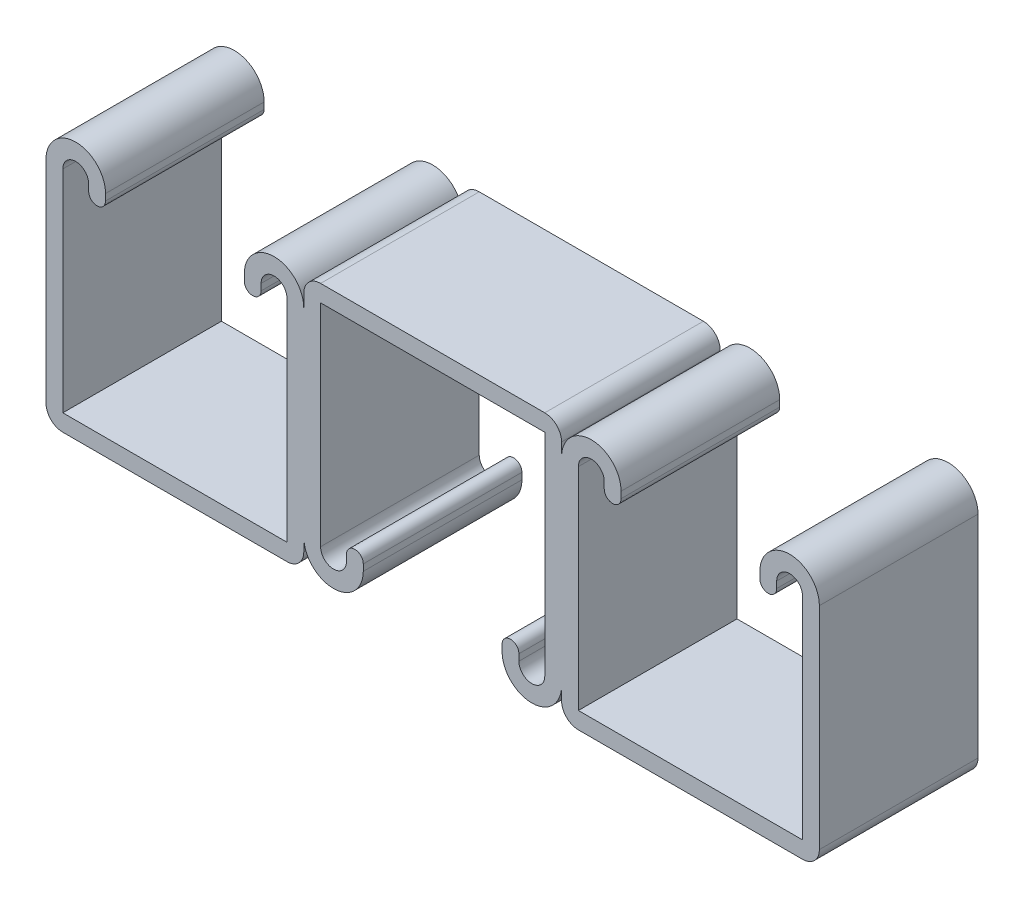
ISO-10303-21;
HEADER;
FILE_DESCRIPTION(('STEP AP214'),'2;1');
FILE_NAME('part.step','',(''),(''),'','','');
FILE_SCHEMA(('AUTOMOTIVE_DESIGN { 1 0 10303 214 1 1 1 1 }'));
ENDSEC;
DATA;
#1=APPLICATION_CONTEXT('core data for automotive mechanical design processes');
#2=APPLICATION_PROTOCOL_DEFINITION('international standard','automotive_design',2000,#1);
#3=PRODUCT_CONTEXT('',#1,'mechanical');
#4=PRODUCT('Part','Part','',(#3));
#5=PRODUCT_RELATED_PRODUCT_CATEGORY('part','',(#4));
#6=PRODUCT_DEFINITION_FORMATION('','',#4);
#7=PRODUCT_DEFINITION_CONTEXT('part definition',#1,'design');
#8=PRODUCT_DEFINITION('design','',#6,#7);
#9=PRODUCT_DEFINITION_SHAPE('','',#8);
#10=(LENGTH_UNIT() NAMED_UNIT(*) SI_UNIT(.MILLI.,.METRE.));
#11=(NAMED_UNIT(*) PLANE_ANGLE_UNIT() SI_UNIT($,.RADIAN.));
#12=(NAMED_UNIT(*) SI_UNIT($,.STERADIAN.) SOLID_ANGLE_UNIT());
#13=UNCERTAINTY_MEASURE_WITH_UNIT(LENGTH_MEASURE(1.E-05),#10,'distance_accuracy_value','');
#14=(GEOMETRIC_REPRESENTATION_CONTEXT(3) GLOBAL_UNCERTAINTY_ASSIGNED_CONTEXT((#13)) GLOBAL_UNIT_ASSIGNED_CONTEXT((#10,
#11,#12)) REPRESENTATION_CONTEXT('',''));
#15=CARTESIAN_POINT('',(0.,0.,0.));
#16=DIRECTION('',(0.,0.,1.));
#17=DIRECTION('',(1.,0.,0.));
#18=AXIS2_PLACEMENT_3D('',#15,#16,#17);
#19=CARTESIAN_POINT('',(41.2750000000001,-15.8749999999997,12.7));
#20=DIRECTION('',(-1.,0.,0.));
#21=DIRECTION('',(0.,-1.,0.));
#22=AXIS2_PLACEMENT_3D('',#19,#20,#21);
#23=PLANE('',#22);
#24=DIRECTION('',(0.,0.,-1.));
#25=VECTOR('',#24,1.);
#26=CARTESIAN_POINT('',(41.275,15.875,12.7));
#27=LINE('',#26,#25);
#28=CARTESIAN_POINT('',(41.2749999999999,15.875,12.7));
#29=VERTEX_POINT('',#28);
#30=CARTESIAN_POINT('',(41.275,15.875,-12.7));
#31=VERTEX_POINT('',#30);
#32=EDGE_CURVE('E402',#29,#31,#27,.T.);
#33=ORIENTED_EDGE('',*,*,#32,.T.);
#34=DIRECTION('',(0.,1.,0.));
#35=VECTOR('',#34,1.);
#36=CARTESIAN_POINT('',(41.2750000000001,-15.8749999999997,-12.7));
#37=LINE('',#36,#35);
#38=CARTESIAN_POINT('',(41.2749999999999,17.9451000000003,-12.7));
#39=VERTEX_POINT('',#38);
#40=EDGE_CURVE('E563',#31,#39,#37,.T.);
#41=ORIENTED_EDGE('',*,*,#40,.T.);
#42=DIRECTION('',(0.,0.,-1.));
#43=VECTOR('',#42,1.);
#44=CARTESIAN_POINT('',(41.2749999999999,17.9451000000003,12.7));
#45=LINE('',#44,#43);
#46=CARTESIAN_POINT('',(41.2749999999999,17.9451000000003,12.7));
#47=VERTEX_POINT('',#46);
#48=EDGE_CURVE('E642',#47,#39,#45,.T.);
#49=ORIENTED_EDGE('',*,*,#48,.F.);
#50=DIRECTION('',(0.,1.,0.));
#51=VECTOR('',#50,1.);
#52=CARTESIAN_POINT('',(41.2750000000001,-15.8749999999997,12.7));
#53=LINE('',#52,#51);
#54=EDGE_CURVE('E54',#29,#47,#53,.T.);
#55=ORIENTED_EDGE('',*,*,#54,.F.);
#56=EDGE_LOOP('',(#33,#41,#49,#55));
#57=FACE_BOUND('',#56,.T.);
#58=ADVANCED_FACE('F39',(#57),#23,.F.);
#59=CARTESIAN_POINT('',(-36.5125,15.875,12.7));
#60=DIRECTION('',(0.,0.,-1.));
#61=DIRECTION('',(-1.,0.,0.));
#62=AXIS2_PLACEMENT_3D('',#59,#60,#61);
#63=CYLINDRICAL_SURFACE('',#62,4.7625);
#64=CARTESIAN_POINT('',(-36.5125,15.875,-12.7));
#65=DIRECTION('',(0.,0.,1.));
#66=DIRECTION('',(-1.,0.,0.));
#67=AXIS2_PLACEMENT_3D('',#64,#65,#66);
#68=CIRCLE('',#67,4.7625);
#69=CARTESIAN_POINT('',(-31.75,15.875,-12.7));
#70=VERTEX_POINT('',#69);
#71=CARTESIAN_POINT('',(-41.275,15.875,-12.7));
#72=VERTEX_POINT('',#71);
#73=EDGE_CURVE('E647',#70,#72,#68,.T.);
#74=ORIENTED_EDGE('',*,*,#73,.T.);
#75=DIRECTION('',(0.,0.,-1.));
#76=VECTOR('',#75,1.);
#77=CARTESIAN_POINT('',(-41.275,15.875,12.7));
#78=LINE('',#77,#76);
#79=CARTESIAN_POINT('',(-41.275,15.875,12.7));
#80=VERTEX_POINT('',#79);
#81=EDGE_CURVE('E11',#80,#72,#78,.T.);
#82=ORIENTED_EDGE('',*,*,#81,.F.);
#83=CARTESIAN_POINT('',(-36.5125,15.875,12.7));
#84=DIRECTION('',(0.,0.,1.));
#85=DIRECTION('',(-1.,0.,0.));
#86=AXIS2_PLACEMENT_3D('',#83,#84,#85);
#87=CIRCLE('',#86,4.7625);
#88=CARTESIAN_POINT('',(-31.75,15.875,12.7));
#89=VERTEX_POINT('',#88);
#90=EDGE_CURVE('E648',#89,#80,#87,.T.);
#91=ORIENTED_EDGE('',*,*,#90,.F.);
#92=DIRECTION('',(0.,0.,-1.));
#93=VECTOR('',#92,1.);
#94=CARTESIAN_POINT('',(-31.75,15.875,12.7));
#95=LINE('',#94,#93);
#96=EDGE_CURVE('E685',#89,#70,#95,.T.);
#97=ORIENTED_EDGE('',*,*,#96,.T.);
#98=EDGE_LOOP('',(#74,#82,#91,#97));
#99=FACE_BOUND('',#98,.T.);
#100=ADVANCED_FACE('F41',(#99),#63,.T.);
#101=CARTESIAN_POINT('',(-41.275,15.875,12.7));
#102=DIRECTION('',(1.,0.,0.));
#103=DIRECTION('',(0.,1.,0.));
#104=AXIS2_PLACEMENT_3D('',#101,#102,#103);
#105=PLANE('',#104);
#106=DIRECTION('',(0.,-1.,0.));
#107=VECTOR('',#106,1.);
#108=CARTESIAN_POINT('',(-41.275,15.875,-12.7));
#109=LINE('',#108,#107);
#110=CARTESIAN_POINT('',(-41.275,-17.9451,-12.7));
#111=VERTEX_POINT('',#110);
#112=EDGE_CURVE('E688',#72,#111,#109,.T.);
#113=ORIENTED_EDGE('',*,*,#112,.T.);
#114=DIRECTION('',(0.,0.,-1.));
#115=VECTOR('',#114,1.);
#116=CARTESIAN_POINT('',(-41.275,-17.9451,12.7));
#117=LINE('',#116,#115);
#118=CARTESIAN_POINT('',(-41.275,-17.9451,12.7));
#119=VERTEX_POINT('',#118);
#120=EDGE_CURVE('E47',#119,#111,#117,.T.);
#121=ORIENTED_EDGE('',*,*,#120,.F.);
#122=DIRECTION('',(0.,-1.,0.));
#123=VECTOR('',#122,1.);
#124=CARTESIAN_POINT('',(-41.275,15.875,12.7));
#125=LINE('',#124,#123);
#126=EDGE_CURVE('E650',#80,#119,#125,.T.);
#127=ORIENTED_EDGE('',*,*,#126,.F.);
#128=ORIENTED_EDGE('',*,*,#81,.T.);
#129=EDGE_LOOP('',(#113,#121,#127,#128));
#130=FACE_BOUND('',#129,.T.);
#131=ADVANCED_FACE('F792',(#130),#105,.F.);
#132=CARTESIAN_POINT('',(-38.5826,-17.9451,12.7));
#133=DIRECTION('',(0.,0.,-1.));
#134=DIRECTION('',(-1.,0.,0.));
#135=AXIS2_PLACEMENT_3D('',#132,#133,#134);
#136=CYLINDRICAL_SURFACE('',#135,2.6924);
#137=CARTESIAN_POINT('',(-38.5826,-17.9451,-12.7));
#138=DIRECTION('',(0.,0.,1.));
#139=DIRECTION('',(-1.,0.,0.));
#140=AXIS2_PLACEMENT_3D('',#137,#138,#139);
#141=CIRCLE('',#140,2.6924);
#142=CARTESIAN_POINT('',(-38.5826,-20.6375,-12.7));
#143=VERTEX_POINT('',#142);
#144=EDGE_CURVE('E690',#111,#143,#141,.T.);
#145=ORIENTED_EDGE('',*,*,#144,.T.);
#146=DIRECTION('',(0.,0.,-1.));
#147=VECTOR('',#146,1.);
#148=CARTESIAN_POINT('',(-38.5826,-20.6375,12.7));
#149=LINE('',#148,#147);
#150=CARTESIAN_POINT('',(-38.5826,-20.6375,12.7));
#151=VERTEX_POINT('',#150);
#152=EDGE_CURVE('E765',#151,#143,#149,.T.);
#153=ORIENTED_EDGE('',*,*,#152,.F.);
#154=CARTESIAN_POINT('',(-38.5826,-17.9451,12.7));
#155=DIRECTION('',(0.,0.,1.));
#156=DIRECTION('',(-1.,0.,0.));
#157=AXIS2_PLACEMENT_3D('',#154,#155,#156);
#158=CIRCLE('',#157,2.6924);
#159=EDGE_CURVE('E653',#119,#151,#158,.T.);
#160=ORIENTED_EDGE('',*,*,#159,.F.);
#161=ORIENTED_EDGE('',*,*,#120,.T.);
#162=EDGE_LOOP('',(#145,#153,#160,#161));
#163=FACE_BOUND('',#162,.T.);
#164=ADVANCED_FACE('F772',(#163),#136,.T.);
#165=CARTESIAN_POINT('',(-38.5826,-20.6375,12.7));
#166=DIRECTION('',(0.,1.,0.));
#167=DIRECTION('',(0.,0.,1.));
#168=AXIS2_PLACEMENT_3D('',#165,#166,#167);
#169=PLANE('',#168);
#170=DIRECTION('',(1.,0.,0.));
#171=VECTOR('',#170,1.);
#172=CARTESIAN_POINT('',(-38.5826,-20.6375,-12.7));
#173=LINE('',#172,#171);
#174=CARTESIAN_POINT('',(-2.6924,-20.6375,-12.7));
#175=VERTEX_POINT('',#174);
#176=EDGE_CURVE('E692',#143,#175,#173,.T.);
#177=ORIENTED_EDGE('',*,*,#176,.T.);
#178=DIRECTION('',(0.,0.,-1.));
#179=VECTOR('',#178,1.);
#180=CARTESIAN_POINT('',(-2.6924,-20.6375,12.7));
#181=LINE('',#180,#179);
#182=CARTESIAN_POINT('',(-2.6924,-20.6375,12.7));
#183=VERTEX_POINT('',#182);
#184=EDGE_CURVE('E762',#183,#175,#181,.T.);
#185=ORIENTED_EDGE('',*,*,#184,.F.);
#186=DIRECTION('',(1.,0.,0.));
#187=VECTOR('',#186,1.);
#188=CARTESIAN_POINT('',(-38.5826,-20.6375,12.7));
#189=LINE('',#188,#187);
#190=EDGE_CURVE('E655',#151,#183,#189,.T.);
#191=ORIENTED_EDGE('',*,*,#190,.F.);
#192=ORIENTED_EDGE('',*,*,#152,.T.);
#193=EDGE_LOOP('',(#177,#185,#191,#192));
#194=FACE_BOUND('',#193,.T.);
#195=ADVANCED_FACE('F783',(#194),#169,.F.);
#196=CARTESIAN_POINT('',(-2.6924,-17.9451,12.7));
#197=DIRECTION('',(0.,0.,-1.));
#198=DIRECTION('',(-1.,0.,0.));
#199=AXIS2_PLACEMENT_3D('',#196,#197,#198);
#200=CYLINDRICAL_SURFACE('',#199,2.6924);
#201=CARTESIAN_POINT('',(-2.6924,-17.9451,-12.7));
#202=DIRECTION('',(0.,0.,1.));
#203=DIRECTION('',(1.,0.,0.));
#204=AXIS2_PLACEMENT_3D('',#201,#202,#203);
#205=CIRCLE('',#204,2.6924);
#206=CARTESIAN_POINT('',(0.,-17.9451,-12.7));
#207=VERTEX_POINT('',#206);
#208=EDGE_CURVE('E694',#175,#207,#205,.T.);
#209=ORIENTED_EDGE('',*,*,#208,.T.);
#210=DIRECTION('',(0.,0.,-1.));
#211=VECTOR('',#210,1.);
#212=CARTESIAN_POINT('',(0.,-17.9451,12.7));
#213=LINE('',#212,#211);
#214=CARTESIAN_POINT('',(0.,-17.9451,12.7));
#215=VERTEX_POINT('',#214);
#216=EDGE_CURVE('E759',#215,#207,#213,.T.);
#217=ORIENTED_EDGE('',*,*,#216,.F.);
#218=CARTESIAN_POINT('',(-2.6924,-17.9451,12.7));
#219=DIRECTION('',(0.,0.,1.));
#220=DIRECTION('',(1.,0.,0.));
#221=AXIS2_PLACEMENT_3D('',#218,#219,#220);
#222=CIRCLE('',#221,2.6924);
#223=EDGE_CURVE('E657',#183,#215,#222,.T.);
#224=ORIENTED_EDGE('',*,*,#223,.F.);
#225=ORIENTED_EDGE('',*,*,#184,.T.);
#226=EDGE_LOOP('',(#209,#217,#224,#225));
#227=FACE_BOUND('',#226,.T.);
#228=ADVANCED_FACE('F787',(#227),#200,.T.);
#229=CARTESIAN_POINT('',(0.,-17.9451,12.7));
#230=DIRECTION('',(-1.,0.,0.));
#231=DIRECTION('',(0.,0.,1.));
#232=AXIS2_PLACEMENT_3D('',#229,#230,#231);
#233=PLANE('',#232);
#234=DIRECTION('',(0.,1.,0.));
#235=VECTOR('',#234,1.);
#236=CARTESIAN_POINT('',(0.,-17.9451,-12.7));
#237=LINE('',#236,#235);
#238=CARTESIAN_POINT('',(0.,-15.875,-12.7));
#239=VERTEX_POINT('',#238);
#240=EDGE_CURVE('E696',#207,#239,#237,.T.);
#241=ORIENTED_EDGE('',*,*,#240,.T.);
#242=DIRECTION('',(0.,0.,-1.));
#243=VECTOR('',#242,1.);
#244=CARTESIAN_POINT('',(1.10854532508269E-13,-15.875,12.7));
#245=LINE('',#244,#243);
#246=CARTESIAN_POINT('',(0.,-15.875,12.7));
#247=VERTEX_POINT('',#246);
#248=EDGE_CURVE('E62',#247,#239,#245,.T.);
#249=ORIENTED_EDGE('',*,*,#248,.F.);
#250=DIRECTION('',(0.,1.,0.));
#251=VECTOR('',#250,1.);
#252=CARTESIAN_POINT('',(0.,-17.9451,12.7));
#253=LINE('',#252,#251);
#254=EDGE_CURVE('E659',#215,#247,#253,.T.);
#255=ORIENTED_EDGE('',*,*,#254,.F.);
#256=ORIENTED_EDGE('',*,*,#216,.T.);
#257=EDGE_LOOP('',(#241,#249,#255,#256));
#258=FACE_BOUND('',#257,.T.);
#259=ADVANCED_FACE('F1060',(#258),#233,.F.);
#260=CARTESIAN_POINT('',(-4.7625,15.875,12.7));
#261=DIRECTION('',(0.,0.,-1.));
#262=DIRECTION('',(-1.,0.,0.));
#263=AXIS2_PLACEMENT_3D('',#260,#261,#262);
#264=CYLINDRICAL_SURFACE('',#263,4.7625);
#265=CARTESIAN_POINT('',(-4.7625,15.875,-12.7));
#266=DIRECTION('',(0.,0.,1.));
#267=DIRECTION('',(1.,0.,0.));
#268=AXIS2_PLACEMENT_3D('',#265,#266,#267);
#269=CIRCLE('',#268,4.7625);
#270=CARTESIAN_POINT('',(-1.1085453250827E-13,15.875,-12.7));
#271=VERTEX_POINT('',#270);
#272=CARTESIAN_POINT('',(-9.525,15.875,-12.7));
#273=VERTEX_POINT('',#272);
#274=EDGE_CURVE('E698',#271,#273,#269,.T.);
#275=ORIENTED_EDGE('',*,*,#274,.T.);
#276=DIRECTION('',(0.,0.,-1.));
#277=VECTOR('',#276,1.);
#278=CARTESIAN_POINT('',(-9.525,15.875,12.7));
#279=LINE('',#278,#277);
#280=CARTESIAN_POINT('',(-9.525,15.875,12.7));
#281=VERTEX_POINT('',#280);
#282=EDGE_CURVE('E753',#281,#273,#279,.T.);
#283=ORIENTED_EDGE('',*,*,#282,.F.);
#284=CARTESIAN_POINT('',(-4.7625,15.875,12.7));
#285=DIRECTION('',(0.,0.,1.));
#286=DIRECTION('',(1.,0.,0.));
#287=AXIS2_PLACEMENT_3D('',#284,#285,#286);
#288=CIRCLE('',#287,4.7625);
#289=CARTESIAN_POINT('',(0.,15.875,12.7));
#290=VERTEX_POINT('',#289);
#291=EDGE_CURVE('E661',#290,#281,#288,.T.);
#292=ORIENTED_EDGE('',*,*,#291,.F.);
#293=DIRECTION('',(0.,0.,-1.));
#294=VECTOR('',#293,1.);
#295=CARTESIAN_POINT('',(0.,15.875,12.7));
#296=LINE('',#295,#294);
#297=EDGE_CURVE('E756',#290,#271,#296,.T.);
#298=ORIENTED_EDGE('',*,*,#297,.T.);
#299=EDGE_LOOP('',(#275,#283,#292,#298));
#300=FACE_BOUND('',#299,.T.);
#301=ADVANCED_FACE('F851',(#300),#264,.T.);
#302=CARTESIAN_POINT('',(-9.525,15.875,12.7));
#303=DIRECTION('',(1.,0.,0.));
#304=DIRECTION('',(0.,0.,-1.));
#305=AXIS2_PLACEMENT_3D('',#302,#303,#304);
#306=PLANE('',#305);
#307=DIRECTION('',(0.,-1.,0.));
#308=VECTOR('',#307,1.);
#309=CARTESIAN_POINT('',(-9.525,15.875,-12.7));
#310=LINE('',#309,#308);
#311=CARTESIAN_POINT('',(-9.525,14.83995,-12.7));
#312=VERTEX_POINT('',#311);
#313=EDGE_CURVE('E700',#273,#312,#310,.T.);
#314=ORIENTED_EDGE('',*,*,#313,.T.);
#315=DIRECTION('',(0.,0.,-1.));
#316=VECTOR('',#315,1.);
#317=CARTESIAN_POINT('',(-9.525,14.83995,12.7));
#318=LINE('',#317,#316);
#319=CARTESIAN_POINT('',(-9.525,14.83995,12.7));
#320=VERTEX_POINT('',#319);
#321=EDGE_CURVE('E750',#320,#312,#318,.T.);
#322=ORIENTED_EDGE('',*,*,#321,.F.);
#323=DIRECTION('',(0.,-1.,0.));
#324=VECTOR('',#323,1.);
#325=CARTESIAN_POINT('',(-9.525,15.875,12.7));
#326=LINE('',#325,#324);
#327=EDGE_CURVE('E663',#281,#320,#326,.T.);
#328=ORIENTED_EDGE('',*,*,#327,.F.);
#329=ORIENTED_EDGE('',*,*,#282,.T.);
#330=EDGE_LOOP('',(#314,#322,#328,#329));
#331=FACE_BOUND('',#330,.T.);
#332=ADVANCED_FACE('F848',(#331),#306,.F.);
#333=CARTESIAN_POINT('',(-8.1788,14.83995,12.7));
#334=DIRECTION('',(0.,0.,-1.));
#335=DIRECTION('',(-1.,0.,0.));
#336=AXIS2_PLACEMENT_3D('',#333,#334,#335);
#337=CYLINDRICAL_SURFACE('',#336,1.3462);
#338=CARTESIAN_POINT('',(-8.1788,14.83995,-12.7));
#339=DIRECTION('',(0.,0.,1.));
#340=DIRECTION('',(1.,0.,0.));
#341=AXIS2_PLACEMENT_3D('',#338,#339,#340);
#342=CIRCLE('',#341,1.3462);
#343=CARTESIAN_POINT('',(-6.83260000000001,14.83995,-12.7));
#344=VERTEX_POINT('',#343);
#345=EDGE_CURVE('E702',#312,#344,#342,.T.);
#346=ORIENTED_EDGE('',*,*,#345,.T.);
#347=DIRECTION('',(0.,0.,-1.));
#348=VECTOR('',#347,1.);
#349=CARTESIAN_POINT('',(-6.83260000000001,14.83995,12.7));
#350=LINE('',#349,#348);
#351=CARTESIAN_POINT('',(-6.83260000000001,14.83995,12.7));
#352=VERTEX_POINT('',#351);
#353=EDGE_CURVE('E747',#352,#344,#350,.T.);
#354=ORIENTED_EDGE('',*,*,#353,.F.);
#355=CARTESIAN_POINT('',(-8.1788,14.83995,12.7));
#356=DIRECTION('',(0.,0.,1.));
#357=DIRECTION('',(1.,0.,0.));
#358=AXIS2_PLACEMENT_3D('',#355,#356,#357);
#359=CIRCLE('',#358,1.3462);
#360=EDGE_CURVE('E665',#320,#352,#359,.T.);
#361=ORIENTED_EDGE('',*,*,#360,.F.);
#362=ORIENTED_EDGE('',*,*,#321,.T.);
#363=EDGE_LOOP('',(#346,#354,#361,#362));
#364=FACE_BOUND('',#363,.T.);
#365=ADVANCED_FACE('F843',(#364),#337,.T.);
#366=CARTESIAN_POINT('',(-6.8326,15.875,12.7));
#367=DIRECTION('',(-1.,0.,0.));
#368=DIRECTION('',(0.,0.,1.));
#369=AXIS2_PLACEMENT_3D('',#366,#367,#368);
#370=PLANE('',#369);
#371=DIRECTION('',(0.,1.,0.));
#372=VECTOR('',#371,1.);
#373=CARTESIAN_POINT('',(-6.8326,15.875,-12.7));
#374=LINE('',#373,#372);
#375=CARTESIAN_POINT('',(-6.8326,15.875,-12.7));
#376=VERTEX_POINT('',#375);
#377=EDGE_CURVE('E704',#344,#376,#374,.T.);
#378=ORIENTED_EDGE('',*,*,#377,.T.);
#379=DIRECTION('',(0.,0.,-1.));
#380=VECTOR('',#379,1.);
#381=CARTESIAN_POINT('',(-6.8326,15.875,12.7));
#382=LINE('',#381,#380);
#383=CARTESIAN_POINT('',(-6.8326,15.875,12.7));
#384=VERTEX_POINT('',#383);
#385=EDGE_CURVE('E744',#384,#376,#382,.T.);
#386=ORIENTED_EDGE('',*,*,#385,.F.);
#387=DIRECTION('',(0.,1.,0.));
#388=VECTOR('',#387,1.);
#389=CARTESIAN_POINT('',(-6.8326,15.875,12.7));
#390=LINE('',#389,#388);
#391=EDGE_CURVE('E667',#352,#384,#390,.T.);
#392=ORIENTED_EDGE('',*,*,#391,.F.);
#393=ORIENTED_EDGE('',*,*,#353,.T.);
#394=EDGE_LOOP('',(#378,#386,#392,#393));
#395=FACE_BOUND('',#394,.T.);
#396=ADVANCED_FACE('F838',(#395),#370,.F.);
#397=CARTESIAN_POINT('',(-4.7625,15.875,12.7));
#398=DIRECTION('',(0.,0.,-1.));
#399=DIRECTION('',(-1.,0.,0.));
#400=AXIS2_PLACEMENT_3D('',#397,#398,#399);
#401=CYLINDRICAL_SURFACE('',#400,2.0701);
#402=CARTESIAN_POINT('',(-4.7625,15.875,-12.7));
#403=DIRECTION('',(0.,0.,-1.));
#404=DIRECTION('',(1.,0.,0.));
#405=AXIS2_PLACEMENT_3D('',#402,#403,#404);
#406=CIRCLE('',#405,2.0701);
#407=CARTESIAN_POINT('',(-2.6924,15.875,-12.7));
#408=VERTEX_POINT('',#407);
#409=EDGE_CURVE('E706',#376,#408,#406,.T.);
#410=ORIENTED_EDGE('',*,*,#409,.T.);
#411=DIRECTION('',(0.,0.,-1.));
#412=VECTOR('',#411,1.);
#413=CARTESIAN_POINT('',(-2.6924,15.875,12.7));
#414=LINE('',#413,#412);
#415=CARTESIAN_POINT('',(-2.6924,15.875,12.7));
#416=VERTEX_POINT('',#415);
#417=EDGE_CURVE('E741',#416,#408,#414,.T.);
#418=ORIENTED_EDGE('',*,*,#417,.F.);
#419=CARTESIAN_POINT('',(-4.7625,15.875,12.7));
#420=DIRECTION('',(0.,0.,-1.));
#421=DIRECTION('',(1.,0.,0.));
#422=AXIS2_PLACEMENT_3D('',#419,#420,#421);
#423=CIRCLE('',#422,2.0701);
#424=EDGE_CURVE('E669',#384,#416,#423,.T.);
#425=ORIENTED_EDGE('',*,*,#424,.F.);
#426=ORIENTED_EDGE('',*,*,#385,.T.);
#427=EDGE_LOOP('',(#410,#418,#425,#426));
#428=FACE_BOUND('',#427,.T.);
#429=ADVANCED_FACE('F834',(#428),#401,.F.);
#430=CARTESIAN_POINT('',(-2.6924,-17.9451,12.7));
#431=DIRECTION('',(1.,0.,0.));
#432=DIRECTION('',(0.,0.,-1.));
#433=AXIS2_PLACEMENT_3D('',#430,#431,#432);
#434=PLANE('',#433);
#435=DIRECTION('',(0.,-1.,0.));
#436=VECTOR('',#435,1.);
#437=CARTESIAN_POINT('',(-2.6924,-17.9451,-12.7));
#438=LINE('',#437,#436);
#439=CARTESIAN_POINT('',(-2.6924,-17.9451,-12.7));
#440=VERTEX_POINT('',#439);
#441=EDGE_CURVE('E708',#408,#440,#438,.T.);
#442=ORIENTED_EDGE('',*,*,#441,.T.);
#443=DIRECTION('',(0.,0.,-1.));
#444=VECTOR('',#443,1.);
#445=CARTESIAN_POINT('',(-2.6924,-17.9451,12.7));
#446=LINE('',#445,#444);
#447=CARTESIAN_POINT('',(-2.6924,-17.9451,12.7));
#448=VERTEX_POINT('',#447);
#449=EDGE_CURVE('E738',#448,#440,#446,.T.);
#450=ORIENTED_EDGE('',*,*,#449,.F.);
#451=DIRECTION('',(0.,-1.,0.));
#452=VECTOR('',#451,1.);
#453=CARTESIAN_POINT('',(-2.6924,-17.9451,12.7));
#454=LINE('',#453,#452);
#455=EDGE_CURVE('E671',#416,#448,#454,.T.);
#456=ORIENTED_EDGE('',*,*,#455,.F.);
#457=ORIENTED_EDGE('',*,*,#417,.T.);
#458=EDGE_LOOP('',(#442,#450,#456,#457));
#459=FACE_BOUND('',#458,.T.);
#460=ADVANCED_FACE('F829',(#459),#434,.F.);
#461=CARTESIAN_POINT('',(-38.5826,-17.9451,12.7));
#462=DIRECTION('',(0.,-1.,0.));
#463=DIRECTION('',(0.,0.,-1.));
#464=AXIS2_PLACEMENT_3D('',#461,#462,#463);
#465=PLANE('',#464);
#466=DIRECTION('',(-1.,0.,0.));
#467=VECTOR('',#466,1.);
#468=CARTESIAN_POINT('',(-38.5826,-17.9451,-12.7));
#469=LINE('',#468,#467);
#470=CARTESIAN_POINT('',(-38.5826,-17.9451,-12.7));
#471=VERTEX_POINT('',#470);
#472=EDGE_CURVE('E710',#440,#471,#469,.T.);
#473=ORIENTED_EDGE('',*,*,#472,.T.);
#474=DIRECTION('',(0.,0.,-1.));
#475=VECTOR('',#474,1.);
#476=CARTESIAN_POINT('',(-38.5826,-17.9451,12.7));
#477=LINE('',#476,#475);
#478=CARTESIAN_POINT('',(-38.5826,-17.9451,12.7));
#479=VERTEX_POINT('',#478);
#480=EDGE_CURVE('E735',#479,#471,#477,.T.);
#481=ORIENTED_EDGE('',*,*,#480,.F.);
#482=DIRECTION('',(-1.,0.,0.));
#483=VECTOR('',#482,1.);
#484=CARTESIAN_POINT('',(-38.5826,-17.9451,12.7));
#485=LINE('',#484,#483);
#486=EDGE_CURVE('E673',#448,#479,#485,.T.);
#487=ORIENTED_EDGE('',*,*,#486,.F.);
#488=ORIENTED_EDGE('',*,*,#449,.T.);
#489=EDGE_LOOP('',(#473,#481,#487,#488));
#490=FACE_BOUND('',#489,.T.);
#491=ADVANCED_FACE('F823',(#490),#465,.F.);
#492=CARTESIAN_POINT('',(-38.5826,15.875,12.7));
#493=DIRECTION('',(-1.,0.,0.));
#494=DIRECTION('',(0.,-1.,0.));
#495=AXIS2_PLACEMENT_3D('',#492,#493,#494);
#496=PLANE('',#495);
#497=DIRECTION('',(0.,1.,0.));
#498=VECTOR('',#497,1.);
#499=CARTESIAN_POINT('',(-38.5826,15.875,-12.7));
#500=LINE('',#499,#498);
#501=CARTESIAN_POINT('',(-38.5826,15.875,-12.7));
#502=VERTEX_POINT('',#501);
#503=EDGE_CURVE('E712',#471,#502,#500,.T.);
#504=ORIENTED_EDGE('',*,*,#503,.T.);
#505=DIRECTION('',(0.,0.,-1.));
#506=VECTOR('',#505,1.);
#507=CARTESIAN_POINT('',(-38.5826,15.875,12.7));
#508=LINE('',#507,#506);
#509=CARTESIAN_POINT('',(-38.5826,15.875,12.7));
#510=VERTEX_POINT('',#509);
#511=EDGE_CURVE('E732',#510,#502,#508,.T.);
#512=ORIENTED_EDGE('',*,*,#511,.F.);
#513=DIRECTION('',(0.,1.,0.));
#514=VECTOR('',#513,1.);
#515=CARTESIAN_POINT('',(-38.5826,15.875,12.7));
#516=LINE('',#515,#514);
#517=EDGE_CURVE('E675',#479,#510,#516,.T.);
#518=ORIENTED_EDGE('',*,*,#517,.F.);
#519=ORIENTED_EDGE('',*,*,#480,.T.);
#520=EDGE_LOOP('',(#504,#512,#518,#519));
#521=FACE_BOUND('',#520,.T.);
#522=ADVANCED_FACE('F819',(#521),#496,.F.);
#523=CARTESIAN_POINT('',(-36.5125,15.875,12.7));
#524=DIRECTION('',(0.,0.,-1.));
#525=DIRECTION('',(-1.,0.,0.));
#526=AXIS2_PLACEMENT_3D('',#523,#524,#525);
#527=CYLINDRICAL_SURFACE('',#526,2.0701);
#528=CARTESIAN_POINT('',(-36.5125,15.875,-12.7));
#529=DIRECTION('',(0.,0.,-1.));
#530=DIRECTION('',(-1.,0.,0.));
#531=AXIS2_PLACEMENT_3D('',#528,#529,#530);
#532=CIRCLE('',#531,2.0701);
#533=CARTESIAN_POINT('',(-34.4424,15.875,-12.7));
#534=VERTEX_POINT('',#533);
#535=EDGE_CURVE('E714',#502,#534,#532,.T.);
#536=ORIENTED_EDGE('',*,*,#535,.T.);
#537=DIRECTION('',(0.,0.,-1.));
#538=VECTOR('',#537,1.);
#539=CARTESIAN_POINT('',(-34.4424,15.875,12.7));
#540=LINE('',#539,#538);
#541=CARTESIAN_POINT('',(-34.4424,15.875,12.7));
#542=VERTEX_POINT('',#541);
#543=EDGE_CURVE('E729',#542,#534,#540,.T.);
#544=ORIENTED_EDGE('',*,*,#543,.F.);
#545=CARTESIAN_POINT('',(-36.5125,15.875,12.7));
#546=DIRECTION('',(0.,0.,-1.));
#547=DIRECTION('',(-1.,0.,0.));
#548=AXIS2_PLACEMENT_3D('',#545,#546,#547);
#549=CIRCLE('',#548,2.0701);
#550=EDGE_CURVE('E677',#510,#542,#549,.T.);
#551=ORIENTED_EDGE('',*,*,#550,.F.);
#552=ORIENTED_EDGE('',*,*,#511,.T.);
#553=EDGE_LOOP('',(#536,#544,#551,#552));
#554=FACE_BOUND('',#553,.T.);
#555=ADVANCED_FACE('F814',(#554),#527,.F.);
#556=CARTESIAN_POINT('',(-34.4424,15.875,12.7));
#557=DIRECTION('',(1.,0.,0.));
#558=DIRECTION('',(0.,1.,0.));
#559=AXIS2_PLACEMENT_3D('',#556,#557,#558);
#560=PLANE('',#559);
#561=DIRECTION('',(0.,-1.,0.));
#562=VECTOR('',#561,1.);
#563=CARTESIAN_POINT('',(-34.4424,15.875,-12.7));
#564=LINE('',#563,#562);
#565=CARTESIAN_POINT('',(-34.4424,14.83995,-12.7));
#566=VERTEX_POINT('',#565);
#567=EDGE_CURVE('E716',#534,#566,#564,.T.);
#568=ORIENTED_EDGE('',*,*,#567,.T.);
#569=DIRECTION('',(0.,0.,-1.));
#570=VECTOR('',#569,1.);
#571=CARTESIAN_POINT('',(-34.4424,14.83995,12.7));
#572=LINE('',#571,#570);
#573=CARTESIAN_POINT('',(-34.4424,14.83995,12.7));
#574=VERTEX_POINT('',#573);
#575=EDGE_CURVE('E726',#574,#566,#572,.T.);
#576=ORIENTED_EDGE('',*,*,#575,.F.);
#577=DIRECTION('',(0.,-1.,0.));
#578=VECTOR('',#577,1.);
#579=CARTESIAN_POINT('',(-34.4424,15.875,12.7));
#580=LINE('',#579,#578);
#581=EDGE_CURVE('E679',#542,#574,#580,.T.);
#582=ORIENTED_EDGE('',*,*,#581,.F.);
#583=ORIENTED_EDGE('',*,*,#543,.T.);
#584=EDGE_LOOP('',(#568,#576,#582,#583));
#585=FACE_BOUND('',#584,.T.);
#586=ADVANCED_FACE('F808',(#585),#560,.F.);
#587=CARTESIAN_POINT('',(-33.0962,14.83995,12.7));
#588=DIRECTION('',(0.,0.,-1.));
#589=DIRECTION('',(-1.,0.,0.));
#590=AXIS2_PLACEMENT_3D('',#587,#588,#589);
#591=CYLINDRICAL_SURFACE('',#590,1.3462);
#592=CARTESIAN_POINT('',(-33.0962,14.83995,-12.7));
#593=DIRECTION('',(0.,0.,1.));
#594=DIRECTION('',(-1.,0.,0.));
#595=AXIS2_PLACEMENT_3D('',#592,#593,#594);
#596=CIRCLE('',#595,1.3462);
#597=CARTESIAN_POINT('',(-31.75,14.83995,-12.7));
#598=VERTEX_POINT('',#597);
#599=EDGE_CURVE('E718',#566,#598,#596,.T.);
#600=ORIENTED_EDGE('',*,*,#599,.T.);
#601=DIRECTION('',(0.,0.,-1.));
#602=VECTOR('',#601,1.);
#603=CARTESIAN_POINT('',(-31.75,14.83995,12.7));
#604=LINE('',#603,#602);
#605=CARTESIAN_POINT('',(-31.75,14.83995,12.7));
#606=VERTEX_POINT('',#605);
#607=EDGE_CURVE('E723',#606,#598,#604,.T.);
#608=ORIENTED_EDGE('',*,*,#607,.F.);
#609=CARTESIAN_POINT('',(-33.0962,14.83995,12.7));
#610=DIRECTION('',(0.,0.,1.));
#611=DIRECTION('',(-1.,0.,0.));
#612=AXIS2_PLACEMENT_3D('',#609,#610,#611);
#613=CIRCLE('',#612,1.3462);
#614=EDGE_CURVE('E681',#574,#606,#613,.T.);
#615=ORIENTED_EDGE('',*,*,#614,.F.);
#616=ORIENTED_EDGE('',*,*,#575,.T.);
#617=EDGE_LOOP('',(#600,#608,#615,#616));
#618=FACE_BOUND('',#617,.T.);
#619=ADVANCED_FACE('F804',(#618),#591,.T.);
#620=CARTESIAN_POINT('',(-31.75,15.875,12.7));
#621=DIRECTION('',(-1.,0.,0.));
#622=DIRECTION('',(0.,-1.,0.));
#623=AXIS2_PLACEMENT_3D('',#620,#621,#622);
#624=PLANE('',#623);
#625=DIRECTION('',(0.,1.,0.));
#626=VECTOR('',#625,1.);
#627=CARTESIAN_POINT('',(-31.75,15.875,-12.7));
#628=LINE('',#627,#626);
#629=EDGE_CURVE('E651',#598,#70,#628,.T.);
#630=ORIENTED_EDGE('',*,*,#629,.T.);
#631=ORIENTED_EDGE('',*,*,#96,.F.);
#632=DIRECTION('',(0.,1.,0.));
#633=VECTOR('',#632,1.);
#634=CARTESIAN_POINT('',(-31.75,15.875,12.7));
#635=LINE('',#634,#633);
#636=EDGE_CURVE('E683',#606,#89,#635,.T.);
#637=ORIENTED_EDGE('',*,*,#636,.F.);
#638=ORIENTED_EDGE('',*,*,#607,.T.);
#639=EDGE_LOOP('',(#630,#631,#637,#638));
#640=FACE_BOUND('',#639,.T.);
#641=ADVANCED_FACE('F799',(#640),#624,.F.);
#642=CARTESIAN_POINT('',(-36.5125,15.875,12.7));
#643=DIRECTION('',(0.,0.,-1.));
#644=DIRECTION('',(-1.,0.,0.));
#645=AXIS2_PLACEMENT_3D('',#642,#643,#644);
#646=PLANE('',#645);
#647=ORIENTED_EDGE('',*,*,#90,.T.);
#648=ORIENTED_EDGE('',*,*,#126,.T.);
#649=ORIENTED_EDGE('',*,*,#159,.T.);
#650=ORIENTED_EDGE('',*,*,#190,.T.);
#651=ORIENTED_EDGE('',*,*,#223,.T.);
#652=ORIENTED_EDGE('',*,*,#254,.T.);
#653=CARTESIAN_POINT('',(4.76250000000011,-15.875,12.7));
#654=DIRECTION('',(0.,0.,1.));
#655=DIRECTION('',(-1.,0.,0.));
#656=AXIS2_PLACEMENT_3D('',#653,#654,#655);
#657=CIRCLE('',#656,4.7625);
#658=CARTESIAN_POINT('',(9.52500000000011,-15.8749999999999,12.7));
#659=VERTEX_POINT('',#658);
#660=EDGE_CURVE('E537',#247,#659,#657,.T.);
#661=ORIENTED_EDGE('',*,*,#660,.T.);
#662=DIRECTION('',(0.,1.,0.));
#663=VECTOR('',#662,1.);
#664=CARTESIAN_POINT('',(9.52500000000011,-15.8749999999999,12.7));
#665=LINE('',#664,#663);
#666=CARTESIAN_POINT('',(9.52500000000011,-14.8399499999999,12.7));
#667=VERTEX_POINT('',#666);
#668=EDGE_CURVE('E539',#659,#667,#665,.T.);
#669=ORIENTED_EDGE('',*,*,#668,.T.);
#670=CARTESIAN_POINT('',(8.17880000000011,-14.8399499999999,12.7));
#671=DIRECTION('',(0.,0.,1.));
#672=DIRECTION('',(-1.,0.,0.));
#673=AXIS2_PLACEMENT_3D('',#670,#671,#672);
#674=CIRCLE('',#673,1.3462);
#675=CARTESIAN_POINT('',(6.83260000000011,-14.8399499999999,12.7));
#676=VERTEX_POINT('',#675);
#677=EDGE_CURVE('E541',#667,#676,#674,.T.);
#678=ORIENTED_EDGE('',*,*,#677,.T.);
#679=DIRECTION('',(0.,-1.,0.));
#680=VECTOR('',#679,1.);
#681=CARTESIAN_POINT('',(6.83260000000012,-15.8749999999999,12.7));
#682=LINE('',#681,#680);
#683=CARTESIAN_POINT('',(6.83260000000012,-15.8749999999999,12.7));
#684=VERTEX_POINT('',#683);
#685=EDGE_CURVE('E543',#676,#684,#682,.T.);
#686=ORIENTED_EDGE('',*,*,#685,.T.);
#687=CARTESIAN_POINT('',(4.76250000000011,-15.875,12.7));
#688=DIRECTION('',(0.,0.,-1.));
#689=DIRECTION('',(-1.,0.,0.));
#690=AXIS2_PLACEMENT_3D('',#687,#688,#689);
#691=CIRCLE('',#690,2.0701);
#692=CARTESIAN_POINT('',(2.69240000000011,-15.875,12.7));
#693=VERTEX_POINT('',#692);
#694=EDGE_CURVE('E545',#684,#693,#691,.T.);
#695=ORIENTED_EDGE('',*,*,#694,.T.);
#696=DIRECTION('',(0.,1.,0.));
#697=VECTOR('',#696,1.);
#698=CARTESIAN_POINT('',(2.69239999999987,17.9451,12.7));
#699=LINE('',#698,#697);
#700=CARTESIAN_POINT('',(2.69239999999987,17.9451,12.7));
#701=VERTEX_POINT('',#700);
#702=EDGE_CURVE('E547',#693,#701,#699,.T.);
#703=ORIENTED_EDGE('',*,*,#702,.T.);
#704=DIRECTION('',(1.,0.,0.));
#705=VECTOR('',#704,1.);
#706=CARTESIAN_POINT('',(38.5825999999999,17.9451000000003,12.7));
#707=LINE('',#706,#705);
#708=CARTESIAN_POINT('',(38.5825999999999,17.9451000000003,12.7));
#709=VERTEX_POINT('',#708);
#710=EDGE_CURVE('E549',#701,#709,#707,.T.);
#711=ORIENTED_EDGE('',*,*,#710,.T.);
#712=DIRECTION('',(0.,-1.,0.));
#713=VECTOR('',#712,1.);
#714=CARTESIAN_POINT('',(38.5826000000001,-15.8749999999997,12.7));
#715=LINE('',#714,#713);
#716=CARTESIAN_POINT('',(38.5826000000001,-15.8749999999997,12.7));
#717=VERTEX_POINT('',#716);
#718=EDGE_CURVE('E551',#709,#717,#715,.T.);
#719=ORIENTED_EDGE('',*,*,#718,.T.);
#720=CARTESIAN_POINT('',(36.5125000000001,-15.8749999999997,12.7));
#721=DIRECTION('',(0.,0.,-1.));
#722=DIRECTION('',(1.,0.,0.));
#723=AXIS2_PLACEMENT_3D('',#720,#721,#722);
#724=CIRCLE('',#723,2.0701);
#725=CARTESIAN_POINT('',(34.4424000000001,-15.8749999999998,12.7));
#726=VERTEX_POINT('',#725);
#727=EDGE_CURVE('E553',#717,#726,#724,.T.);
#728=ORIENTED_EDGE('',*,*,#727,.T.);
#729=DIRECTION('',(0.,1.,0.));
#730=VECTOR('',#729,1.);
#731=CARTESIAN_POINT('',(34.4424000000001,-15.8749999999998,12.7));
#732=LINE('',#731,#730);
#733=CARTESIAN_POINT('',(34.4424000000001,-14.8399499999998,12.7));
#734=VERTEX_POINT('',#733);
#735=EDGE_CURVE('E555',#726,#734,#732,.T.);
#736=ORIENTED_EDGE('',*,*,#735,.T.);
#737=CARTESIAN_POINT('',(33.0962000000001,-14.8399499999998,12.7));
#738=DIRECTION('',(0.,0.,1.));
#739=DIRECTION('',(1.,0.,0.));
#740=AXIS2_PLACEMENT_3D('',#737,#738,#739);
#741=CIRCLE('',#740,1.3462);
#742=CARTESIAN_POINT('',(31.7500000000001,-14.8399499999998,12.7));
#743=VERTEX_POINT('',#742);
#744=EDGE_CURVE('E557',#734,#743,#741,.T.);
#745=ORIENTED_EDGE('',*,*,#744,.T.);
#746=DIRECTION('',(0.,-1.,0.));
#747=VECTOR('',#746,1.);
#748=CARTESIAN_POINT('',(31.7500000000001,-15.8749999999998,12.7));
#749=LINE('',#748,#747);
#750=CARTESIAN_POINT('',(31.7500000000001,-15.8749999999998,12.7));
#751=VERTEX_POINT('',#750);
#752=EDGE_CURVE('E559',#743,#751,#749,.T.);
#753=ORIENTED_EDGE('',*,*,#752,.T.);
#754=CARTESIAN_POINT('',(36.5125000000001,-15.8749999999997,12.7));
#755=DIRECTION('',(0.,0.,1.));
#756=DIRECTION('',(1.,0.,0.));
#757=AXIS2_PLACEMENT_3D('',#754,#755,#756);
#758=CIRCLE('',#757,4.7625);
#759=CARTESIAN_POINT('',(41.2750000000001,-15.8749999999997,12.7));
#760=VERTEX_POINT('',#759);
#761=EDGE_CURVE('E389',#751,#760,#758,.T.);
#762=ORIENTED_EDGE('',*,*,#761,.T.);
#763=DIRECTION('',(0.,-1.,0.));
#764=VECTOR('',#763,1.);
#765=CARTESIAN_POINT('',(41.275,15.875,12.7));
#766=LINE('',#765,#764);
#767=CARTESIAN_POINT('',(41.275,-17.9451,12.7));
#768=VERTEX_POINT('',#767);
#769=EDGE_CURVE('E381',#760,#768,#766,.T.);
#770=ORIENTED_EDGE('',*,*,#769,.T.);
#771=CARTESIAN_POINT('',(43.9674,-17.9451,12.7));
#772=DIRECTION('',(0.,0.,1.));
#773=DIRECTION('',(-1.,0.,0.));
#774=AXIS2_PLACEMENT_3D('',#771,#772,#773);
#775=CIRCLE('',#774,2.6924);
#776=CARTESIAN_POINT('',(43.9674,-20.6375,12.7));
#777=VERTEX_POINT('',#776);
#778=EDGE_CURVE('E386',#768,#777,#775,.T.);
#779=ORIENTED_EDGE('',*,*,#778,.T.);
#780=DIRECTION('',(1.,0.,0.));
#781=VECTOR('',#780,1.);
#782=CARTESIAN_POINT('',(43.9674,-20.6375,12.7));
#783=LINE('',#782,#781);
#784=CARTESIAN_POINT('',(79.8576,-20.6375,12.7));
#785=VERTEX_POINT('',#784);
#786=EDGE_CURVE('E408',#777,#785,#783,.T.);
#787=ORIENTED_EDGE('',*,*,#786,.T.);
#788=CARTESIAN_POINT('',(79.8576,-17.9451,12.7));
#789=DIRECTION('',(0.,0.,1.));
#790=DIRECTION('',(1.,0.,0.));
#791=AXIS2_PLACEMENT_3D('',#788,#789,#790);
#792=CIRCLE('',#791,2.6924);
#793=CARTESIAN_POINT('',(82.55,-17.9451,12.7));
#794=VERTEX_POINT('',#793);
#795=EDGE_CURVE('E410',#785,#794,#792,.T.);
#796=ORIENTED_EDGE('',*,*,#795,.T.);
#797=DIRECTION('',(0.,1.,0.));
#798=VECTOR('',#797,1.);
#799=CARTESIAN_POINT('',(82.55,-17.9451,12.7));
#800=LINE('',#799,#798);
#801=CARTESIAN_POINT('',(82.55,15.875,12.7));
#802=VERTEX_POINT('',#801);
#803=EDGE_CURVE('E415',#794,#802,#800,.T.);
#804=ORIENTED_EDGE('',*,*,#803,.T.);
#805=CARTESIAN_POINT('',(77.7875,15.875,12.7));
#806=DIRECTION('',(0.,0.,1.));
#807=DIRECTION('',(1.,0.,0.));
#808=AXIS2_PLACEMENT_3D('',#805,#806,#807);
#809=CIRCLE('',#808,4.7625);
#810=CARTESIAN_POINT('',(73.025,15.875,12.7));
#811=VERTEX_POINT('',#810);
#812=EDGE_CURVE('E417',#802,#811,#809,.T.);
#813=ORIENTED_EDGE('',*,*,#812,.T.);
#814=DIRECTION('',(0.,-1.,0.));
#815=VECTOR('',#814,1.);
#816=CARTESIAN_POINT('',(73.025,15.875,12.7));
#817=LINE('',#816,#815);
#818=CARTESIAN_POINT('',(73.025,14.83995,12.7));
#819=VERTEX_POINT('',#818);
#820=EDGE_CURVE('E419',#811,#819,#817,.T.);
#821=ORIENTED_EDGE('',*,*,#820,.T.);
#822=CARTESIAN_POINT('',(74.3712,14.83995,12.7));
#823=DIRECTION('',(0.,0.,1.));
#824=DIRECTION('',(1.,0.,0.));
#825=AXIS2_PLACEMENT_3D('',#822,#823,#824);
#826=CIRCLE('',#825,1.3462);
#827=CARTESIAN_POINT('',(75.7174,14.83995,12.7));
#828=VERTEX_POINT('',#827);
#829=EDGE_CURVE('E421',#819,#828,#826,.T.);
#830=ORIENTED_EDGE('',*,*,#829,.T.);
#831=DIRECTION('',(0.,1.,0.));
#832=VECTOR('',#831,1.);
#833=CARTESIAN_POINT('',(75.7174,15.875,12.7));
#834=LINE('',#833,#832);
#835=CARTESIAN_POINT('',(75.7174,15.875,12.7));
#836=VERTEX_POINT('',#835);
#837=EDGE_CURVE('E423',#828,#836,#834,.T.);
#838=ORIENTED_EDGE('',*,*,#837,.T.);
#839=CARTESIAN_POINT('',(77.7875,15.875,12.7));
#840=DIRECTION('',(0.,0.,-1.));
#841=DIRECTION('',(1.,0.,0.));
#842=AXIS2_PLACEMENT_3D('',#839,#840,#841);
#843=CIRCLE('',#842,2.0701);
#844=CARTESIAN_POINT('',(79.8576,15.875,12.7));
#845=VERTEX_POINT('',#844);
#846=EDGE_CURVE('E425',#836,#845,#843,.T.);
#847=ORIENTED_EDGE('',*,*,#846,.T.);
#848=DIRECTION('',(0.,-1.,0.));
#849=VECTOR('',#848,1.);
#850=CARTESIAN_POINT('',(79.8576,-17.9451,12.7));
#851=LINE('',#850,#849);
#852=CARTESIAN_POINT('',(79.8576,-17.9451,12.7));
#853=VERTEX_POINT('',#852);
#854=EDGE_CURVE('E427',#845,#853,#851,.T.);
#855=ORIENTED_EDGE('',*,*,#854,.T.);
#856=DIRECTION('',(-1.,0.,0.));
#857=VECTOR('',#856,1.);
#858=CARTESIAN_POINT('',(43.9674,-17.9451,12.7));
#859=LINE('',#858,#857);
#860=CARTESIAN_POINT('',(43.9674,-17.9451,12.7));
#861=VERTEX_POINT('',#860);
#862=EDGE_CURVE('E429',#853,#861,#859,.T.);
#863=ORIENTED_EDGE('',*,*,#862,.T.);
#864=DIRECTION('',(0.,1.,0.));
#865=VECTOR('',#864,1.);
#866=CARTESIAN_POINT('',(43.9674,15.875,12.7));
#867=LINE('',#866,#865);
#868=CARTESIAN_POINT('',(43.9674,15.875,12.7));
#869=VERTEX_POINT('',#868);
#870=EDGE_CURVE('E431',#861,#869,#867,.T.);
#871=ORIENTED_EDGE('',*,*,#870,.T.);
#872=CARTESIAN_POINT('',(46.0375,15.875,12.7));
#873=DIRECTION('',(0.,0.,-1.));
#874=DIRECTION('',(-1.,0.,0.));
#875=AXIS2_PLACEMENT_3D('',#872,#873,#874);
#876=CIRCLE('',#875,2.0701);
#877=CARTESIAN_POINT('',(48.1076,15.875,12.7));
#878=VERTEX_POINT('',#877);
#879=EDGE_CURVE('E433',#869,#878,#876,.T.);
#880=ORIENTED_EDGE('',*,*,#879,.T.);
#881=DIRECTION('',(0.,-1.,0.));
#882=VECTOR('',#881,1.);
#883=CARTESIAN_POINT('',(48.1076,15.875,12.7));
#884=LINE('',#883,#882);
#885=CARTESIAN_POINT('',(48.1076,14.83995,12.7));
#886=VERTEX_POINT('',#885);
#887=EDGE_CURVE('E435',#878,#886,#884,.T.);
#888=ORIENTED_EDGE('',*,*,#887,.T.);
#889=CARTESIAN_POINT('',(49.4538,14.83995,12.7));
#890=DIRECTION('',(0.,0.,1.));
#891=DIRECTION('',(-1.,0.,0.));
#892=AXIS2_PLACEMENT_3D('',#889,#890,#891);
#893=CIRCLE('',#892,1.3462);
#894=CARTESIAN_POINT('',(50.8,14.83995,12.7));
#895=VERTEX_POINT('',#894);
#896=EDGE_CURVE('E437',#886,#895,#893,.T.);
#897=ORIENTED_EDGE('',*,*,#896,.T.);
#898=DIRECTION('',(0.,1.,0.));
#899=VECTOR('',#898,1.);
#900=CARTESIAN_POINT('',(50.8,15.875,12.7));
#901=LINE('',#900,#899);
#902=CARTESIAN_POINT('',(50.8,15.875,12.7));
#903=VERTEX_POINT('',#902);
#904=EDGE_CURVE('E439',#895,#903,#901,.T.);
#905=ORIENTED_EDGE('',*,*,#904,.T.);
#906=CARTESIAN_POINT('',(46.0375,15.875,12.7));
#907=DIRECTION('',(0.,0.,1.));
#908=DIRECTION('',(-1.,0.,0.));
#909=AXIS2_PLACEMENT_3D('',#906,#907,#908);
#910=CIRCLE('',#909,4.7625);
#911=EDGE_CURVE('E393',#903,#29,#910,.T.);
#912=ORIENTED_EDGE('',*,*,#911,.T.);
#913=ORIENTED_EDGE('',*,*,#54,.T.);
#914=CARTESIAN_POINT('',(38.5825999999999,17.9451000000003,12.7));
#915=DIRECTION('',(0.,0.,1.));
#916=DIRECTION('',(1.,0.,0.));
#917=AXIS2_PLACEMENT_3D('',#914,#915,#916);
#918=CIRCLE('',#917,2.6924);
#919=CARTESIAN_POINT('',(38.5825999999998,20.6375000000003,12.7));
#920=VERTEX_POINT('',#919);
#921=EDGE_CURVE('E528',#47,#920,#918,.T.);
#922=ORIENTED_EDGE('',*,*,#921,.T.);
#923=DIRECTION('',(-1.,0.,0.));
#924=VECTOR('',#923,1.);
#925=CARTESIAN_POINT('',(38.5825999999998,20.6375000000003,12.7));
#926=LINE('',#925,#924);
#927=CARTESIAN_POINT('',(2.69239999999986,20.6375,12.7));
#928=VERTEX_POINT('',#927);
#929=EDGE_CURVE('E530',#920,#928,#926,.T.);
#930=ORIENTED_EDGE('',*,*,#929,.T.);
#931=CARTESIAN_POINT('',(2.69239999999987,17.9451,12.7));
#932=DIRECTION('',(0.,0.,1.));
#933=DIRECTION('',(-1.,0.,0.));
#934=AXIS2_PLACEMENT_3D('',#931,#932,#933);
#935=CIRCLE('',#934,2.6924);
#936=CARTESIAN_POINT('',(-1.24442601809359E-13,17.9451,12.7));
#937=VERTEX_POINT('',#936);
#938=EDGE_CURVE('E532',#928,#937,#935,.T.);
#939=ORIENTED_EDGE('',*,*,#938,.T.);
#940=DIRECTION('',(0.,-1.,0.));
#941=VECTOR('',#940,1.);
#942=CARTESIAN_POINT('',(-1.25309963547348E-13,17.9451,12.7));
#943=LINE('',#942,#941);
#944=EDGE_CURVE('E534',#937,#290,#943,.T.);
#945=ORIENTED_EDGE('',*,*,#944,.T.);
#946=ORIENTED_EDGE('',*,*,#291,.T.);
#947=ORIENTED_EDGE('',*,*,#327,.T.);
#948=ORIENTED_EDGE('',*,*,#360,.T.);
#949=ORIENTED_EDGE('',*,*,#391,.T.);
#950=ORIENTED_EDGE('',*,*,#424,.T.);
#951=ORIENTED_EDGE('',*,*,#455,.T.);
#952=ORIENTED_EDGE('',*,*,#486,.T.);
#953=ORIENTED_EDGE('',*,*,#517,.T.);
#954=ORIENTED_EDGE('',*,*,#550,.T.);
#955=ORIENTED_EDGE('',*,*,#581,.T.);
#956=ORIENTED_EDGE('',*,*,#614,.T.);
#957=ORIENTED_EDGE('',*,*,#636,.T.);
#958=EDGE_LOOP('',(#647,#648,#649,#650,#651,#652,#661,#669,#678,#686,#695,#703,#711,#719,#728,
#736,#745,#753,#762,#770,#779,#787,#796,#804,#813,#821,#830,#838,#847,#855,#863,#871,#880,#888,
#897,#905,#912,#913,#922,#930,#939,#945,#946,#947,#948,#949,#950,#951,#952,#953,#954,#955,#956,#957));
#959=FACE_BOUND('',#958,.T.);
#960=ADVANCED_FACE('F384',(#959),#646,.F.);
#961=CARTESIAN_POINT('',(-36.5125,15.875,-12.7));
#962=DIRECTION('',(0.,0.,-1.));
#963=DIRECTION('',(-1.,0.,0.));
#964=AXIS2_PLACEMENT_3D('',#961,#962,#963);
#965=PLANE('',#964);
#966=ORIENTED_EDGE('',*,*,#73,.F.);
#967=ORIENTED_EDGE('',*,*,#629,.F.);
#968=ORIENTED_EDGE('',*,*,#599,.F.);
#969=ORIENTED_EDGE('',*,*,#567,.F.);
#970=ORIENTED_EDGE('',*,*,#535,.F.);
#971=ORIENTED_EDGE('',*,*,#503,.F.);
#972=ORIENTED_EDGE('',*,*,#472,.F.);
#973=ORIENTED_EDGE('',*,*,#441,.F.);
#974=ORIENTED_EDGE('',*,*,#409,.F.);
#975=ORIENTED_EDGE('',*,*,#377,.F.);
#976=ORIENTED_EDGE('',*,*,#345,.F.);
#977=ORIENTED_EDGE('',*,*,#313,.F.);
#978=ORIENTED_EDGE('',*,*,#274,.F.);
#979=DIRECTION('',(0.,-1.,0.));
#980=VECTOR('',#979,1.);
#981=CARTESIAN_POINT('',(-1.25309963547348E-13,17.9451,-12.7));
#982=LINE('',#981,#980);
#983=CARTESIAN_POINT('',(-1.24442601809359E-13,17.9451,-12.7));
#984=VERTEX_POINT('',#983);
#985=EDGE_CURVE('E571',#984,#271,#982,.T.);
#986=ORIENTED_EDGE('',*,*,#985,.F.);
#987=CARTESIAN_POINT('',(2.69239999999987,17.9451,-12.7));
#988=DIRECTION('',(0.,0.,1.));
#989=DIRECTION('',(-1.,0.,0.));
#990=AXIS2_PLACEMENT_3D('',#987,#988,#989);
#991=CIRCLE('',#990,2.6924);
#992=CARTESIAN_POINT('',(2.69239999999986,20.6375,-12.7));
#993=VERTEX_POINT('',#992);
#994=EDGE_CURVE('E569',#993,#984,#991,.T.);
#995=ORIENTED_EDGE('',*,*,#994,.F.);
#996=DIRECTION('',(-1.,0.,0.));
#997=VECTOR('',#996,1.);
#998=CARTESIAN_POINT('',(38.5825999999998,20.6375000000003,-12.7));
#999=LINE('',#998,#997);
#1000=CARTESIAN_POINT('',(38.5825999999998,20.6375000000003,-12.7));
#1001=VERTEX_POINT('',#1000);
#1002=EDGE_CURVE('E567',#1001,#993,#999,.T.);
#1003=ORIENTED_EDGE('',*,*,#1002,.F.);
#1004=CARTESIAN_POINT('',(38.5825999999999,17.9451000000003,-12.7));
#1005=DIRECTION('',(0.,0.,1.));
#1006=DIRECTION('',(1.,0.,0.));
#1007=AXIS2_PLACEMENT_3D('',#1004,#1005,#1006);
#1008=CIRCLE('',#1007,2.6924);
#1009=EDGE_CURVE('E565',#39,#1001,#1008,.T.);
#1010=ORIENTED_EDGE('',*,*,#1009,.F.);
#1011=ORIENTED_EDGE('',*,*,#40,.F.);
#1012=CARTESIAN_POINT('',(46.0375,15.875,-12.7));
#1013=DIRECTION('',(0.,0.,1.));
#1014=DIRECTION('',(-1.,0.,0.));
#1015=AXIS2_PLACEMENT_3D('',#1012,#1013,#1014);
#1016=CIRCLE('',#1015,4.7625);
#1017=CARTESIAN_POINT('',(50.8,15.875,-12.7));
#1018=VERTEX_POINT('',#1017);
#1019=EDGE_CURVE('E442',#1018,#31,#1016,.T.);
#1020=ORIENTED_EDGE('',*,*,#1019,.F.);
#1021=DIRECTION('',(0.,1.,0.));
#1022=VECTOR('',#1021,1.);
#1023=CARTESIAN_POINT('',(50.8,15.875,-12.7));
#1024=LINE('',#1023,#1022);
#1025=CARTESIAN_POINT('',(50.8,14.83995,-12.7));
#1026=VERTEX_POINT('',#1025);
#1027=EDGE_CURVE('E476',#1026,#1018,#1024,.T.);
#1028=ORIENTED_EDGE('',*,*,#1027,.F.);
#1029=CARTESIAN_POINT('',(49.4538,14.83995,-12.7));
#1030=DIRECTION('',(0.,0.,1.));
#1031=DIRECTION('',(-1.,0.,0.));
#1032=AXIS2_PLACEMENT_3D('',#1029,#1030,#1031);
#1033=CIRCLE('',#1032,1.3462);
#1034=CARTESIAN_POINT('',(48.1076,14.83995,-12.7));
#1035=VERTEX_POINT('',#1034);
#1036=EDGE_CURVE('E474',#1035,#1026,#1033,.T.);
#1037=ORIENTED_EDGE('',*,*,#1036,.F.);
#1038=DIRECTION('',(0.,-1.,0.));
#1039=VECTOR('',#1038,1.);
#1040=CARTESIAN_POINT('',(48.1076,15.875,-12.7));
#1041=LINE('',#1040,#1039);
#1042=CARTESIAN_POINT('',(48.1076,15.875,-12.7));
#1043=VERTEX_POINT('',#1042);
#1044=EDGE_CURVE('E472',#1043,#1035,#1041,.T.);
#1045=ORIENTED_EDGE('',*,*,#1044,.F.);
#1046=CARTESIAN_POINT('',(46.0375,15.875,-12.7));
#1047=DIRECTION('',(0.,0.,-1.));
#1048=DIRECTION('',(-1.,0.,0.));
#1049=AXIS2_PLACEMENT_3D('',#1046,#1047,#1048);
#1050=CIRCLE('',#1049,2.0701);
#1051=CARTESIAN_POINT('',(43.9674,15.875,-12.7));
#1052=VERTEX_POINT('',#1051);
#1053=EDGE_CURVE('E470',#1052,#1043,#1050,.T.);
#1054=ORIENTED_EDGE('',*,*,#1053,.F.);
#1055=DIRECTION('',(0.,1.,0.));
#1056=VECTOR('',#1055,1.);
#1057=CARTESIAN_POINT('',(43.9674,15.875,-12.7));
#1058=LINE('',#1057,#1056);
#1059=CARTESIAN_POINT('',(43.9674,-17.9451,-12.7));
#1060=VERTEX_POINT('',#1059);
#1061=EDGE_CURVE('E468',#1060,#1052,#1058,.T.);
#1062=ORIENTED_EDGE('',*,*,#1061,.F.);
#1063=DIRECTION('',(-1.,0.,0.));
#1064=VECTOR('',#1063,1.);
#1065=CARTESIAN_POINT('',(43.9674,-17.9451,-12.7));
#1066=LINE('',#1065,#1064);
#1067=CARTESIAN_POINT('',(79.8576,-17.9451,-12.7));
#1068=VERTEX_POINT('',#1067);
#1069=EDGE_CURVE('E466',#1068,#1060,#1066,.T.);
#1070=ORIENTED_EDGE('',*,*,#1069,.F.);
#1071=DIRECTION('',(0.,-1.,0.));
#1072=VECTOR('',#1071,1.);
#1073=CARTESIAN_POINT('',(79.8576,-17.9451,-12.7));
#1074=LINE('',#1073,#1072);
#1075=CARTESIAN_POINT('',(79.8576,15.875,-12.7));
#1076=VERTEX_POINT('',#1075);
#1077=EDGE_CURVE('E464',#1076,#1068,#1074,.T.);
#1078=ORIENTED_EDGE('',*,*,#1077,.F.);
#1079=CARTESIAN_POINT('',(77.7875,15.875,-12.7));
#1080=DIRECTION('',(0.,0.,-1.));
#1081=DIRECTION('',(1.,0.,0.));
#1082=AXIS2_PLACEMENT_3D('',#1079,#1080,#1081);
#1083=CIRCLE('',#1082,2.0701);
#1084=CARTESIAN_POINT('',(75.7174,15.875,-12.7));
#1085=VERTEX_POINT('',#1084);
#1086=EDGE_CURVE('E462',#1085,#1076,#1083,.T.);
#1087=ORIENTED_EDGE('',*,*,#1086,.F.);
#1088=DIRECTION('',(0.,1.,0.));
#1089=VECTOR('',#1088,1.);
#1090=CARTESIAN_POINT('',(75.7174,15.875,-12.7));
#1091=LINE('',#1090,#1089);
#1092=CARTESIAN_POINT('',(75.7174,14.83995,-12.7));
#1093=VERTEX_POINT('',#1092);
#1094=EDGE_CURVE('E460',#1093,#1085,#1091,.T.);
#1095=ORIENTED_EDGE('',*,*,#1094,.F.);
#1096=CARTESIAN_POINT('',(74.3712,14.83995,-12.7));
#1097=DIRECTION('',(0.,0.,1.));
#1098=DIRECTION('',(1.,0.,0.));
#1099=AXIS2_PLACEMENT_3D('',#1096,#1097,#1098);
#1100=CIRCLE('',#1099,1.3462);
#1101=CARTESIAN_POINT('',(73.025,14.83995,-12.7));
#1102=VERTEX_POINT('',#1101);
#1103=EDGE_CURVE('E458',#1102,#1093,#1100,.T.);
#1104=ORIENTED_EDGE('',*,*,#1103,.F.);
#1105=DIRECTION('',(0.,-1.,0.));
#1106=VECTOR('',#1105,1.);
#1107=CARTESIAN_POINT('',(73.025,15.875,-12.7));
#1108=LINE('',#1107,#1106);
#1109=CARTESIAN_POINT('',(73.025,15.875,-12.7));
#1110=VERTEX_POINT('',#1109);
#1111=EDGE_CURVE('E456',#1110,#1102,#1108,.T.);
#1112=ORIENTED_EDGE('',*,*,#1111,.F.);
#1113=CARTESIAN_POINT('',(77.7875,15.875,-12.7));
#1114=DIRECTION('',(0.,0.,1.));
#1115=DIRECTION('',(1.,0.,0.));
#1116=AXIS2_PLACEMENT_3D('',#1113,#1114,#1115);
#1117=CIRCLE('',#1116,4.7625);
#1118=CARTESIAN_POINT('',(82.55,15.875,-12.7));
#1119=VERTEX_POINT('',#1118);
#1120=EDGE_CURVE('E454',#1119,#1110,#1117,.T.);
#1121=ORIENTED_EDGE('',*,*,#1120,.F.);
#1122=DIRECTION('',(0.,1.,0.));
#1123=VECTOR('',#1122,1.);
#1124=CARTESIAN_POINT('',(82.55,-17.9451,-12.7));
#1125=LINE('',#1124,#1123);
#1126=CARTESIAN_POINT('',(82.55,-17.9451,-12.7));
#1127=VERTEX_POINT('',#1126);
#1128=EDGE_CURVE('E452',#1127,#1119,#1125,.T.);
#1129=ORIENTED_EDGE('',*,*,#1128,.F.);
#1130=CARTESIAN_POINT('',(79.8576,-17.9451,-12.7));
#1131=DIRECTION('',(0.,0.,1.));
#1132=DIRECTION('',(1.,0.,0.));
#1133=AXIS2_PLACEMENT_3D('',#1130,#1131,#1132);
#1134=CIRCLE('',#1133,2.6924);
#1135=CARTESIAN_POINT('',(79.8576,-20.6375,-12.7));
#1136=VERTEX_POINT('',#1135);
#1137=EDGE_CURVE('E450',#1136,#1127,#1134,.T.);
#1138=ORIENTED_EDGE('',*,*,#1137,.F.);
#1139=DIRECTION('',(1.,0.,0.));
#1140=VECTOR('',#1139,1.);
#1141=CARTESIAN_POINT('',(43.9674,-20.6375,-12.7));
#1142=LINE('',#1141,#1140);
#1143=CARTESIAN_POINT('',(43.9674,-20.6375,-12.7));
#1144=VERTEX_POINT('',#1143);
#1145=EDGE_CURVE('E448',#1144,#1136,#1142,.T.);
#1146=ORIENTED_EDGE('',*,*,#1145,.F.);
#1147=CARTESIAN_POINT('',(43.9674,-17.9451,-12.7));
#1148=DIRECTION('',(0.,0.,1.));
#1149=DIRECTION('',(-1.,0.,0.));
#1150=AXIS2_PLACEMENT_3D('',#1147,#1148,#1149);
#1151=CIRCLE('',#1150,2.6924);
#1152=CARTESIAN_POINT('',(41.275,-17.9451,-12.7));
#1153=VERTEX_POINT('',#1152);
#1154=EDGE_CURVE('E446',#1153,#1144,#1151,.T.);
#1155=ORIENTED_EDGE('',*,*,#1154,.F.);
#1156=DIRECTION('',(0.,-1.,0.));
#1157=VECTOR('',#1156,1.);
#1158=CARTESIAN_POINT('',(41.275,15.875,-12.7));
#1159=LINE('',#1158,#1157);
#1160=CARTESIAN_POINT('',(41.2750000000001,-15.8749999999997,-12.7));
#1161=VERTEX_POINT('',#1160);
#1162=EDGE_CURVE('E399',#1161,#1153,#1159,.T.);
#1163=ORIENTED_EDGE('',*,*,#1162,.F.);
#1164=CARTESIAN_POINT('',(36.5125000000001,-15.8749999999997,-12.7));
#1165=DIRECTION('',(0.,0.,1.));
#1166=DIRECTION('',(1.,0.,0.));
#1167=AXIS2_PLACEMENT_3D('',#1164,#1165,#1166);
#1168=CIRCLE('',#1167,4.7625);
#1169=CARTESIAN_POINT('',(31.7500000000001,-15.8749999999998,-12.7));
#1170=VERTEX_POINT('',#1169);
#1171=EDGE_CURVE('E524',#1170,#1161,#1168,.T.);
#1172=ORIENTED_EDGE('',*,*,#1171,.F.);
#1173=DIRECTION('',(0.,-1.,0.));
#1174=VECTOR('',#1173,1.);
#1175=CARTESIAN_POINT('',(31.7500000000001,-15.8749999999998,-12.7));
#1176=LINE('',#1175,#1174);
#1177=CARTESIAN_POINT('',(31.7500000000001,-14.8399499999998,-12.7));
#1178=VERTEX_POINT('',#1177);
#1179=EDGE_CURVE('E526',#1178,#1170,#1176,.T.);
#1180=ORIENTED_EDGE('',*,*,#1179,.F.);
#1181=CARTESIAN_POINT('',(33.0962000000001,-14.8399499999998,-12.7));
#1182=DIRECTION('',(0.,0.,1.));
#1183=DIRECTION('',(1.,0.,0.));
#1184=AXIS2_PLACEMENT_3D('',#1181,#1182,#1183);
#1185=CIRCLE('',#1184,1.3462);
#1186=CARTESIAN_POINT('',(34.4424000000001,-14.8399499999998,-12.7));
#1187=VERTEX_POINT('',#1186);
#1188=EDGE_CURVE('E594',#1187,#1178,#1185,.T.);
#1189=ORIENTED_EDGE('',*,*,#1188,.F.);
#1190=DIRECTION('',(0.,1.,0.));
#1191=VECTOR('',#1190,1.);
#1192=CARTESIAN_POINT('',(34.4424000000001,-15.8749999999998,-12.7));
#1193=LINE('',#1192,#1191);
#1194=CARTESIAN_POINT('',(34.4424000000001,-15.8749999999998,-12.7));
#1195=VERTEX_POINT('',#1194);
#1196=EDGE_CURVE('E592',#1195,#1187,#1193,.T.);
#1197=ORIENTED_EDGE('',*,*,#1196,.F.);
#1198=CARTESIAN_POINT('',(36.5125000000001,-15.8749999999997,-12.7));
#1199=DIRECTION('',(0.,0.,-1.));
#1200=DIRECTION('',(1.,0.,0.));
#1201=AXIS2_PLACEMENT_3D('',#1198,#1199,#1200);
#1202=CIRCLE('',#1201,2.0701);
#1203=CARTESIAN_POINT('',(38.5826000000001,-15.8749999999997,-12.7));
#1204=VERTEX_POINT('',#1203);
#1205=EDGE_CURVE('E590',#1204,#1195,#1202,.T.);
#1206=ORIENTED_EDGE('',*,*,#1205,.F.);
#1207=DIRECTION('',(0.,-1.,0.));
#1208=VECTOR('',#1207,1.);
#1209=CARTESIAN_POINT('',(38.5826000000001,-15.8749999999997,-12.7));
#1210=LINE('',#1209,#1208);
#1211=CARTESIAN_POINT('',(38.5825999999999,17.9451000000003,-12.7));
#1212=VERTEX_POINT('',#1211);
#1213=EDGE_CURVE('E588',#1212,#1204,#1210,.T.);
#1214=ORIENTED_EDGE('',*,*,#1213,.F.);
#1215=DIRECTION('',(1.,0.,0.));
#1216=VECTOR('',#1215,1.);
#1217=CARTESIAN_POINT('',(38.5825999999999,17.9451000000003,-12.7));
#1218=LINE('',#1217,#1216);
#1219=CARTESIAN_POINT('',(2.69239999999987,17.9451,-12.7));
#1220=VERTEX_POINT('',#1219);
#1221=EDGE_CURVE('E586',#1220,#1212,#1218,.T.);
#1222=ORIENTED_EDGE('',*,*,#1221,.F.);
#1223=DIRECTION('',(0.,1.,0.));
#1224=VECTOR('',#1223,1.);
#1225=CARTESIAN_POINT('',(2.69239999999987,17.9451,-12.7));
#1226=LINE('',#1225,#1224);
#1227=CARTESIAN_POINT('',(2.69240000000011,-15.875,-12.7));
#1228=VERTEX_POINT('',#1227);
#1229=EDGE_CURVE('E584',#1228,#1220,#1226,.T.);
#1230=ORIENTED_EDGE('',*,*,#1229,.F.);
#1231=CARTESIAN_POINT('',(4.76250000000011,-15.875,-12.7));
#1232=DIRECTION('',(0.,0.,-1.));
#1233=DIRECTION('',(-1.,0.,0.));
#1234=AXIS2_PLACEMENT_3D('',#1231,#1232,#1233);
#1235=CIRCLE('',#1234,2.0701);
#1236=CARTESIAN_POINT('',(6.83260000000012,-15.8749999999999,-12.7));
#1237=VERTEX_POINT('',#1236);
#1238=EDGE_CURVE('E582',#1237,#1228,#1235,.T.);
#1239=ORIENTED_EDGE('',*,*,#1238,.F.);
#1240=DIRECTION('',(0.,-1.,0.));
#1241=VECTOR('',#1240,1.);
#1242=CARTESIAN_POINT('',(6.83260000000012,-15.8749999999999,-12.7));
#1243=LINE('',#1242,#1241);
#1244=CARTESIAN_POINT('',(6.83260000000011,-14.8399499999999,-12.7));
#1245=VERTEX_POINT('',#1244);
#1246=EDGE_CURVE('E580',#1245,#1237,#1243,.T.);
#1247=ORIENTED_EDGE('',*,*,#1246,.F.);
#1248=CARTESIAN_POINT('',(8.17880000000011,-14.8399499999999,-12.7));
#1249=DIRECTION('',(0.,0.,1.));
#1250=DIRECTION('',(-1.,0.,0.));
#1251=AXIS2_PLACEMENT_3D('',#1248,#1249,#1250);
#1252=CIRCLE('',#1251,1.3462);
#1253=CARTESIAN_POINT('',(9.52500000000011,-14.8399499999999,-12.7));
#1254=VERTEX_POINT('',#1253);
#1255=EDGE_CURVE('E578',#1254,#1245,#1252,.T.);
#1256=ORIENTED_EDGE('',*,*,#1255,.F.);
#1257=DIRECTION('',(0.,1.,0.));
#1258=VECTOR('',#1257,1.);
#1259=CARTESIAN_POINT('',(9.52500000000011,-15.8749999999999,-12.7));
#1260=LINE('',#1259,#1258);
#1261=CARTESIAN_POINT('',(9.52500000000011,-15.8749999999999,-12.7));
#1262=VERTEX_POINT('',#1261);
#1263=EDGE_CURVE('E576',#1262,#1254,#1260,.T.);
#1264=ORIENTED_EDGE('',*,*,#1263,.F.);
#1265=CARTESIAN_POINT('',(4.76250000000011,-15.875,-12.7));
#1266=DIRECTION('',(0.,0.,1.));
#1267=DIRECTION('',(-1.,0.,0.));
#1268=AXIS2_PLACEMENT_3D('',#1265,#1266,#1267);
#1269=CIRCLE('',#1268,4.7625);
#1270=EDGE_CURVE('E574',#239,#1262,#1269,.T.);
#1271=ORIENTED_EDGE('',*,*,#1270,.F.);
#1272=ORIENTED_EDGE('',*,*,#240,.F.);
#1273=ORIENTED_EDGE('',*,*,#208,.F.);
#1274=ORIENTED_EDGE('',*,*,#176,.F.);
#1275=ORIENTED_EDGE('',*,*,#144,.F.);
#1276=ORIENTED_EDGE('',*,*,#112,.F.);
#1277=EDGE_LOOP('',(#966,#967,#968,#969,#970,#971,#972,#973,#974,#975,#976,#977,#978,#986,#995,
#1003,#1010,#1011,#1020,#1028,#1037,#1045,#1054,#1062,#1070,#1078,#1087,#1095,#1104,#1112,#1121,
#1129,#1138,#1146,#1155,#1163,#1172,#1180,#1189,#1197,#1206,#1214,#1222,#1230,#1239,#1247,#1256,
#1264,#1271,#1272,#1273,#1274,#1275,#1276));
#1278=FACE_BOUND('',#1277,.T.);
#1279=ADVANCED_FACE('F778',(#1278),#965,.T.);
#1280=CARTESIAN_POINT('',(36.5125000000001,-15.8749999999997,12.7));
#1281=DIRECTION('',(0.,0.,-1.));
#1282=DIRECTION('',(-1.,0.,0.));
#1283=AXIS2_PLACEMENT_3D('',#1280,#1281,#1282);
#1284=CYLINDRICAL_SURFACE('',#1283,4.7625);
#1285=ORIENTED_EDGE('',*,*,#1171,.T.);
#1286=DIRECTION('',(0.,0.,-1.));
#1287=VECTOR('',#1286,1.);
#1288=CARTESIAN_POINT('',(41.2750000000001,-15.8749999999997,12.7));
#1289=LINE('',#1288,#1287);
#1290=EDGE_CURVE('E645',#760,#1161,#1289,.T.);
#1291=ORIENTED_EDGE('',*,*,#1290,.F.);
#1292=ORIENTED_EDGE('',*,*,#761,.F.);
#1293=DIRECTION('',(0.,0.,-1.));
#1294=VECTOR('',#1293,1.);
#1295=CARTESIAN_POINT('',(31.7500000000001,-15.8749999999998,12.7));
#1296=LINE('',#1295,#1294);
#1297=EDGE_CURVE('E561',#751,#1170,#1296,.T.);
#1298=ORIENTED_EDGE('',*,*,#1297,.T.);
#1299=EDGE_LOOP('',(#1285,#1291,#1292,#1298));
#1300=FACE_BOUND('',#1299,.T.);
#1301=ADVANCED_FACE('F955',(#1300),#1284,.T.);
#1302=CARTESIAN_POINT('',(38.5825999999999,17.9451000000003,12.7));
#1303=DIRECTION('',(0.,0.,-1.));
#1304=DIRECTION('',(-1.,0.,0.));
#1305=AXIS2_PLACEMENT_3D('',#1302,#1303,#1304);
#1306=CYLINDRICAL_SURFACE('',#1305,2.6924);
#1307=ORIENTED_EDGE('',*,*,#1009,.T.);
#1308=DIRECTION('',(0.,0.,-1.));
#1309=VECTOR('',#1308,1.);
#1310=CARTESIAN_POINT('',(38.5825999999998,20.6375000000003,12.7));
#1311=LINE('',#1310,#1309);
#1312=EDGE_CURVE('E639',#920,#1001,#1311,.T.);
#1313=ORIENTED_EDGE('',*,*,#1312,.F.);
#1314=ORIENTED_EDGE('',*,*,#921,.F.);
#1315=ORIENTED_EDGE('',*,*,#48,.T.);
#1316=EDGE_LOOP('',(#1307,#1313,#1314,#1315));
#1317=FACE_BOUND('',#1316,.T.);
#1318=ADVANCED_FACE('F871',(#1317),#1306,.T.);
#1319=CARTESIAN_POINT('',(38.5825999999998,20.6375000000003,12.7));
#1320=DIRECTION('',(0.,-1.,0.));
#1321=DIRECTION('',(1.,0.,0.));
#1322=AXIS2_PLACEMENT_3D('',#1319,#1320,#1321);
#1323=PLANE('',#1322);
#1324=ORIENTED_EDGE('',*,*,#1002,.T.);
#1325=DIRECTION('',(0.,0.,-1.));
#1326=VECTOR('',#1325,1.);
#1327=CARTESIAN_POINT('',(2.69239999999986,20.6375,12.7));
#1328=LINE('',#1327,#1326);
#1329=EDGE_CURVE('E636',#928,#993,#1328,.T.);
#1330=ORIENTED_EDGE('',*,*,#1329,.F.);
#1331=ORIENTED_EDGE('',*,*,#929,.F.);
#1332=ORIENTED_EDGE('',*,*,#1312,.T.);
#1333=EDGE_LOOP('',(#1324,#1330,#1331,#1332));
#1334=FACE_BOUND('',#1333,.T.);
#1335=ADVANCED_FACE('F866',(#1334),#1323,.F.);
#1336=CARTESIAN_POINT('',(2.69239999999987,17.9451,12.7));
#1337=DIRECTION('',(0.,0.,-1.));
#1338=DIRECTION('',(-1.,0.,0.));
#1339=AXIS2_PLACEMENT_3D('',#1336,#1337,#1338);
#1340=CYLINDRICAL_SURFACE('',#1339,2.6924);
#1341=ORIENTED_EDGE('',*,*,#994,.T.);
#1342=DIRECTION('',(0.,0.,-1.));
#1343=VECTOR('',#1342,1.);
#1344=CARTESIAN_POINT('',(-1.24442601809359E-13,17.9451,12.7));
#1345=LINE('',#1344,#1343);
#1346=EDGE_CURVE('E633',#937,#984,#1345,.T.);
#1347=ORIENTED_EDGE('',*,*,#1346,.F.);
#1348=ORIENTED_EDGE('',*,*,#938,.F.);
#1349=ORIENTED_EDGE('',*,*,#1329,.T.);
#1350=EDGE_LOOP('',(#1341,#1347,#1348,#1349));
#1351=FACE_BOUND('',#1350,.T.);
#1352=ADVANCED_FACE('F862',(#1351),#1340,.T.);
#1353=CARTESIAN_POINT('',(-1.25309963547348E-13,17.9451,12.7));
#1354=DIRECTION('',(1.,0.,0.));
#1355=DIRECTION('',(0.,1.,0.));
#1356=AXIS2_PLACEMENT_3D('',#1353,#1354,#1355);
#1357=PLANE('',#1356);
#1358=ORIENTED_EDGE('',*,*,#297,.F.);
#1359=ORIENTED_EDGE('',*,*,#944,.F.);
#1360=ORIENTED_EDGE('',*,*,#1346,.T.);
#1361=ORIENTED_EDGE('',*,*,#985,.T.);
#1362=EDGE_LOOP('',(#1358,#1359,#1360,#1361));
#1363=FACE_BOUND('',#1362,.T.);
#1364=ADVANCED_FACE('F857',(#1363),#1357,.F.);
#1365=CARTESIAN_POINT('',(4.76250000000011,-15.875,12.7));
#1366=DIRECTION('',(0.,0.,-1.));
#1367=DIRECTION('',(-1.,0.,0.));
#1368=AXIS2_PLACEMENT_3D('',#1365,#1366,#1367);
#1369=CYLINDRICAL_SURFACE('',#1368,4.7625);
#1370=ORIENTED_EDGE('',*,*,#1270,.T.);
#1371=DIRECTION('',(0.,0.,-1.));
#1372=VECTOR('',#1371,1.);
#1373=CARTESIAN_POINT('',(9.52500000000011,-15.8749999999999,12.7));
#1374=LINE('',#1373,#1372);
#1375=EDGE_CURVE('E629',#659,#1262,#1374,.T.);
#1376=ORIENTED_EDGE('',*,*,#1375,.F.);
#1377=ORIENTED_EDGE('',*,*,#660,.F.);
#1378=ORIENTED_EDGE('',*,*,#248,.T.);
#1379=EDGE_LOOP('',(#1370,#1376,#1377,#1378));
#1380=FACE_BOUND('',#1379,.T.);
#1381=ADVANCED_FACE('F1012',(#1380),#1369,.T.);
#1382=CARTESIAN_POINT('',(9.52500000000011,-15.8749999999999,12.7));
#1383=DIRECTION('',(-1.,0.,0.));
#1384=DIRECTION('',(0.,-1.,0.));
#1385=AXIS2_PLACEMENT_3D('',#1382,#1383,#1384);
#1386=PLANE('',#1385);
#1387=ORIENTED_EDGE('',*,*,#1263,.T.);
#1388=DIRECTION('',(0.,0.,-1.));
#1389=VECTOR('',#1388,1.);
#1390=CARTESIAN_POINT('',(9.52500000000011,-14.8399499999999,12.7));
#1391=LINE('',#1390,#1389);
#1392=EDGE_CURVE('E626',#667,#1254,#1391,.T.);
#1393=ORIENTED_EDGE('',*,*,#1392,.F.);
#1394=ORIENTED_EDGE('',*,*,#668,.F.);
#1395=ORIENTED_EDGE('',*,*,#1375,.T.);
#1396=EDGE_LOOP('',(#1387,#1393,#1394,#1395));
#1397=FACE_BOUND('',#1396,.T.);
#1398=ADVANCED_FACE('F1008',(#1397),#1386,.F.);
#1399=CARTESIAN_POINT('',(8.17880000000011,-14.8399499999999,12.7));
#1400=DIRECTION('',(0.,0.,-1.));
#1401=DIRECTION('',(-1.,0.,0.));
#1402=AXIS2_PLACEMENT_3D('',#1399,#1400,#1401);
#1403=CYLINDRICAL_SURFACE('',#1402,1.3462);
#1404=ORIENTED_EDGE('',*,*,#1255,.T.);
#1405=DIRECTION('',(0.,0.,-1.));
#1406=VECTOR('',#1405,1.);
#1407=CARTESIAN_POINT('',(6.83260000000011,-14.8399499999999,12.7));
#1408=LINE('',#1407,#1406);
#1409=EDGE_CURVE('E623',#676,#1245,#1408,.T.);
#1410=ORIENTED_EDGE('',*,*,#1409,.F.);
#1411=ORIENTED_EDGE('',*,*,#677,.F.);
#1412=ORIENTED_EDGE('',*,*,#1392,.T.);
#1413=EDGE_LOOP('',(#1404,#1410,#1411,#1412));
#1414=FACE_BOUND('',#1413,.T.);
#1415=ADVANCED_FACE('F1004',(#1414),#1403,.T.);
#1416=CARTESIAN_POINT('',(6.83260000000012,-15.8749999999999,12.7));
#1417=DIRECTION('',(1.,0.,0.));
#1418=DIRECTION('',(0.,1.,0.));
#1419=AXIS2_PLACEMENT_3D('',#1416,#1417,#1418);
#1420=PLANE('',#1419);
#1421=ORIENTED_EDGE('',*,*,#1246,.T.);
#1422=DIRECTION('',(0.,0.,-1.));
#1423=VECTOR('',#1422,1.);
#1424=CARTESIAN_POINT('',(6.83260000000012,-15.8749999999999,12.7));
#1425=LINE('',#1424,#1423);
#1426=EDGE_CURVE('E620',#684,#1237,#1425,.T.);
#1427=ORIENTED_EDGE('',*,*,#1426,.F.);
#1428=ORIENTED_EDGE('',*,*,#685,.F.);
#1429=ORIENTED_EDGE('',*,*,#1409,.T.);
#1430=EDGE_LOOP('',(#1421,#1427,#1428,#1429));
#1431=FACE_BOUND('',#1430,.T.);
#1432=ADVANCED_FACE('F999',(#1431),#1420,.F.);
#1433=CARTESIAN_POINT('',(4.76250000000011,-15.875,12.7));
#1434=DIRECTION('',(0.,0.,-1.));
#1435=DIRECTION('',(-1.,0.,0.));
#1436=AXIS2_PLACEMENT_3D('',#1433,#1434,#1435);
#1437=CYLINDRICAL_SURFACE('',#1436,2.0701);
#1438=ORIENTED_EDGE('',*,*,#1238,.T.);
#1439=DIRECTION('',(0.,0.,-1.));
#1440=VECTOR('',#1439,1.);
#1441=CARTESIAN_POINT('',(2.69240000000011,-15.875,12.7));
#1442=LINE('',#1441,#1440);
#1443=EDGE_CURVE('E617',#693,#1228,#1442,.T.);
#1444=ORIENTED_EDGE('',*,*,#1443,.F.);
#1445=ORIENTED_EDGE('',*,*,#694,.F.);
#1446=ORIENTED_EDGE('',*,*,#1426,.T.);
#1447=EDGE_LOOP('',(#1438,#1444,#1445,#1446));
#1448=FACE_BOUND('',#1447,.T.);
#1449=ADVANCED_FACE('F993',(#1448),#1437,.F.);
#1450=CARTESIAN_POINT('',(2.69239999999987,17.9451,12.7));
#1451=DIRECTION('',(-1.,0.,0.));
#1452=DIRECTION('',(0.,-1.,0.));
#1453=AXIS2_PLACEMENT_3D('',#1450,#1451,#1452);
#1454=PLANE('',#1453);
#1455=ORIENTED_EDGE('',*,*,#1229,.T.);
#1456=DIRECTION('',(0.,0.,-1.));
#1457=VECTOR('',#1456,1.);
#1458=CARTESIAN_POINT('',(2.69239999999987,17.9451,12.7));
#1459=LINE('',#1458,#1457);
#1460=EDGE_CURVE('E614',#701,#1220,#1459,.T.);
#1461=ORIENTED_EDGE('',*,*,#1460,.F.);
#1462=ORIENTED_EDGE('',*,*,#702,.F.);
#1463=ORIENTED_EDGE('',*,*,#1443,.T.);
#1464=EDGE_LOOP('',(#1455,#1461,#1462,#1463));
#1465=FACE_BOUND('',#1464,.T.);
#1466=ADVANCED_FACE('F989',(#1465),#1454,.F.);
#1467=CARTESIAN_POINT('',(38.5825999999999,17.9451000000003,12.7));
#1468=DIRECTION('',(0.,1.,0.));
#1469=DIRECTION('',(-1.,0.,0.));
#1470=AXIS2_PLACEMENT_3D('',#1467,#1468,#1469);
#1471=PLANE('',#1470);
#1472=ORIENTED_EDGE('',*,*,#1221,.T.);
#1473=DIRECTION('',(0.,0.,-1.));
#1474=VECTOR('',#1473,1.);
#1475=CARTESIAN_POINT('',(38.5825999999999,17.9451000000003,12.7));
#1476=LINE('',#1475,#1474);
#1477=EDGE_CURVE('E611',#709,#1212,#1476,.T.);
#1478=ORIENTED_EDGE('',*,*,#1477,.F.);
#1479=ORIENTED_EDGE('',*,*,#710,.F.);
#1480=ORIENTED_EDGE('',*,*,#1460,.T.);
#1481=EDGE_LOOP('',(#1472,#1478,#1479,#1480));
#1482=FACE_BOUND('',#1481,.T.);
#1483=ADVANCED_FACE('F984',(#1482),#1471,.F.);
#1484=CARTESIAN_POINT('',(38.5826000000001,-15.8749999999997,12.7));
#1485=DIRECTION('',(1.,0.,0.));
#1486=DIRECTION('',(0.,1.,0.));
#1487=AXIS2_PLACEMENT_3D('',#1484,#1485,#1486);
#1488=PLANE('',#1487);
#1489=ORIENTED_EDGE('',*,*,#1213,.T.);
#1490=DIRECTION('',(0.,0.,-1.));
#1491=VECTOR('',#1490,1.);
#1492=CARTESIAN_POINT('',(38.5826000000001,-15.8749999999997,12.7));
#1493=LINE('',#1492,#1491);
#1494=EDGE_CURVE('E608',#717,#1204,#1493,.T.);
#1495=ORIENTED_EDGE('',*,*,#1494,.F.);
#1496=ORIENTED_EDGE('',*,*,#718,.F.);
#1497=ORIENTED_EDGE('',*,*,#1477,.T.);
#1498=EDGE_LOOP('',(#1489,#1495,#1496,#1497));
#1499=FACE_BOUND('',#1498,.T.);
#1500=ADVANCED_FACE('F978',(#1499),#1488,.F.);
#1501=CARTESIAN_POINT('',(36.5125000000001,-15.8749999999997,12.7));
#1502=DIRECTION('',(0.,0.,-1.));
#1503=DIRECTION('',(-1.,0.,0.));
#1504=AXIS2_PLACEMENT_3D('',#1501,#1502,#1503);
#1505=CYLINDRICAL_SURFACE('',#1504,2.0701);
#1506=ORIENTED_EDGE('',*,*,#1205,.T.);
#1507=DIRECTION('',(0.,0.,-1.));
#1508=VECTOR('',#1507,1.);
#1509=CARTESIAN_POINT('',(34.4424000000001,-15.8749999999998,12.7));
#1510=LINE('',#1509,#1508);
#1511=EDGE_CURVE('E605',#726,#1195,#1510,.T.);
#1512=ORIENTED_EDGE('',*,*,#1511,.F.);
#1513=ORIENTED_EDGE('',*,*,#727,.F.);
#1514=ORIENTED_EDGE('',*,*,#1494,.T.);
#1515=EDGE_LOOP('',(#1506,#1512,#1513,#1514));
#1516=FACE_BOUND('',#1515,.T.);
#1517=ADVANCED_FACE('F974',(#1516),#1505,.F.);
#1518=CARTESIAN_POINT('',(34.4424000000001,-15.8749999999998,12.7));
#1519=DIRECTION('',(-1.,0.,0.));
#1520=DIRECTION('',(0.,-1.,0.));
#1521=AXIS2_PLACEMENT_3D('',#1518,#1519,#1520);
#1522=PLANE('',#1521);
#1523=ORIENTED_EDGE('',*,*,#1196,.T.);
#1524=DIRECTION('',(0.,0.,-1.));
#1525=VECTOR('',#1524,1.);
#1526=CARTESIAN_POINT('',(34.4424000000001,-14.8399499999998,12.7));
#1527=LINE('',#1526,#1525);
#1528=EDGE_CURVE('E602',#734,#1187,#1527,.T.);
#1529=ORIENTED_EDGE('',*,*,#1528,.F.);
#1530=ORIENTED_EDGE('',*,*,#735,.F.);
#1531=ORIENTED_EDGE('',*,*,#1511,.T.);
#1532=EDGE_LOOP('',(#1523,#1529,#1530,#1531));
#1533=FACE_BOUND('',#1532,.T.);
#1534=ADVANCED_FACE('F969',(#1533),#1522,.F.);
#1535=CARTESIAN_POINT('',(33.0962000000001,-14.8399499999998,12.7));
#1536=DIRECTION('',(0.,0.,-1.));
#1537=DIRECTION('',(-1.,0.,0.));
#1538=AXIS2_PLACEMENT_3D('',#1535,#1536,#1537);
#1539=CYLINDRICAL_SURFACE('',#1538,1.3462);
#1540=ORIENTED_EDGE('',*,*,#1188,.T.);
#1541=DIRECTION('',(0.,0.,-1.));
#1542=VECTOR('',#1541,1.);
#1543=CARTESIAN_POINT('',(31.7500000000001,-14.8399499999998,12.7));
#1544=LINE('',#1543,#1542);
#1545=EDGE_CURVE('E599',#743,#1178,#1544,.T.);
#1546=ORIENTED_EDGE('',*,*,#1545,.F.);
#1547=ORIENTED_EDGE('',*,*,#744,.F.);
#1548=ORIENTED_EDGE('',*,*,#1528,.T.);
#1549=EDGE_LOOP('',(#1540,#1546,#1547,#1548));
#1550=FACE_BOUND('',#1549,.T.);
#1551=ADVANCED_FACE('F963',(#1550),#1539,.T.);
#1552=CARTESIAN_POINT('',(31.7500000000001,-15.8749999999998,12.7));
#1553=DIRECTION('',(1.,0.,0.));
#1554=DIRECTION('',(0.,1.,0.));
#1555=AXIS2_PLACEMENT_3D('',#1552,#1553,#1554);
#1556=PLANE('',#1555);
#1557=ORIENTED_EDGE('',*,*,#1179,.T.);
#1558=ORIENTED_EDGE('',*,*,#1297,.F.);
#1559=ORIENTED_EDGE('',*,*,#752,.F.);
#1560=ORIENTED_EDGE('',*,*,#1545,.T.);
#1561=EDGE_LOOP('',(#1557,#1558,#1559,#1560));
#1562=FACE_BOUND('',#1561,.T.);
#1563=ADVANCED_FACE('F959',(#1562),#1556,.F.);
#1564=CARTESIAN_POINT('',(41.275,15.875,12.7));
#1565=DIRECTION('',(1.,0.,0.));
#1566=DIRECTION('',(0.,1.,0.));
#1567=AXIS2_PLACEMENT_3D('',#1564,#1565,#1566);
#1568=PLANE('',#1567);
#1569=ORIENTED_EDGE('',*,*,#769,.F.);
#1570=ORIENTED_EDGE('',*,*,#1290,.T.);
#1571=ORIENTED_EDGE('',*,*,#1162,.T.);
#1572=DIRECTION('',(0.,0.,-1.));
#1573=VECTOR('',#1572,1.);
#1574=CARTESIAN_POINT('',(41.275,-17.9451,12.7));
#1575=LINE('',#1574,#1573);
#1576=EDGE_CURVE('E396',#768,#1153,#1575,.T.);
#1577=ORIENTED_EDGE('',*,*,#1576,.F.);
#1578=EDGE_LOOP('',(#1569,#1570,#1571,#1577));
#1579=FACE_BOUND('',#1578,.T.);
#1580=ADVANCED_FACE('F397',(#1579),#1568,.F.);
#1581=CARTESIAN_POINT('',(46.0375,15.875,12.7));
#1582=DIRECTION('',(0.,0.,-1.));
#1583=DIRECTION('',(-1.,0.,0.));
#1584=AXIS2_PLACEMENT_3D('',#1581,#1582,#1583);
#1585=CYLINDRICAL_SURFACE('',#1584,4.7625);
#1586=ORIENTED_EDGE('',*,*,#1019,.T.);
#1587=ORIENTED_EDGE('',*,*,#32,.F.);
#1588=ORIENTED_EDGE('',*,*,#911,.F.);
#1589=DIRECTION('',(0.,0.,-1.));
#1590=VECTOR('',#1589,1.);
#1591=CARTESIAN_POINT('',(50.8,15.875,12.7));
#1592=LINE('',#1591,#1590);
#1593=EDGE_CURVE('E441',#903,#1018,#1592,.T.);
#1594=ORIENTED_EDGE('',*,*,#1593,.T.);
#1595=EDGE_LOOP('',(#1586,#1587,#1588,#1594));
#1596=FACE_BOUND('',#1595,.T.);
#1597=ADVANCED_FACE('F876',(#1596),#1585,.T.);
#1598=CARTESIAN_POINT('',(43.9674,-17.9451,12.7));
#1599=DIRECTION('',(0.,0.,-1.));
#1600=DIRECTION('',(-1.,0.,0.));
#1601=AXIS2_PLACEMENT_3D('',#1598,#1599,#1600);
#1602=CYLINDRICAL_SURFACE('',#1601,2.6924);
#1603=ORIENTED_EDGE('',*,*,#1154,.T.);
#1604=DIRECTION('',(0.,0.,-1.));
#1605=VECTOR('',#1604,1.);
#1606=CARTESIAN_POINT('',(43.9674,-20.6375,12.7));
#1607=LINE('',#1606,#1605);
#1608=EDGE_CURVE('E403',#777,#1144,#1607,.T.);
#1609=ORIENTED_EDGE('',*,*,#1608,.F.);
#1610=ORIENTED_EDGE('',*,*,#778,.F.);
#1611=ORIENTED_EDGE('',*,*,#1576,.T.);
#1612=EDGE_LOOP('',(#1603,#1609,#1610,#1611));
#1613=FACE_BOUND('',#1612,.T.);
#1614=ADVANCED_FACE('F405',(#1613),#1602,.T.);
#1615=CARTESIAN_POINT('',(43.9674,-20.6375,12.7));
#1616=DIRECTION('',(0.,1.,0.));
#1617=DIRECTION('',(0.,0.,1.));
#1618=AXIS2_PLACEMENT_3D('',#1615,#1616,#1617);
#1619=PLANE('',#1618);
#1620=ORIENTED_EDGE('',*,*,#1145,.T.);
#1621=DIRECTION('',(0.,0.,-1.));
#1622=VECTOR('',#1621,1.);
#1623=CARTESIAN_POINT('',(79.8576,-20.6375,12.7));
#1624=LINE('',#1623,#1622);
#1625=EDGE_CURVE('E519',#785,#1136,#1624,.T.);
#1626=ORIENTED_EDGE('',*,*,#1625,.F.);
#1627=ORIENTED_EDGE('',*,*,#786,.F.);
#1628=ORIENTED_EDGE('',*,*,#1608,.T.);
#1629=EDGE_LOOP('',(#1620,#1626,#1627,#1628));
#1630=FACE_BOUND('',#1629,.T.);
#1631=ADVANCED_FACE('F950',(#1630),#1619,.F.);
#1632=CARTESIAN_POINT('',(79.8576,-17.9451,12.7));
#1633=DIRECTION('',(0.,0.,-1.));
#1634=DIRECTION('',(-1.,0.,0.));
#1635=AXIS2_PLACEMENT_3D('',#1632,#1633,#1634);
#1636=CYLINDRICAL_SURFACE('',#1635,2.6924);
#1637=ORIENTED_EDGE('',*,*,#1137,.T.);
#1638=DIRECTION('',(0.,0.,-1.));
#1639=VECTOR('',#1638,1.);
#1640=CARTESIAN_POINT('',(82.55,-17.9451,12.7));
#1641=LINE('',#1640,#1639);
#1642=EDGE_CURVE('E516',#794,#1127,#1641,.T.);
#1643=ORIENTED_EDGE('',*,*,#1642,.F.);
#1644=ORIENTED_EDGE('',*,*,#795,.F.);
#1645=ORIENTED_EDGE('',*,*,#1625,.T.);
#1646=EDGE_LOOP('',(#1637,#1643,#1644,#1645));
#1647=FACE_BOUND('',#1646,.T.);
#1648=ADVANCED_FACE('F947',(#1647),#1636,.T.);
#1649=CARTESIAN_POINT('',(82.55,-17.9451,12.7));
#1650=DIRECTION('',(-1.,0.,0.));
#1651=DIRECTION('',(0.,0.,1.));
#1652=AXIS2_PLACEMENT_3D('',#1649,#1650,#1651);
#1653=PLANE('',#1652);
#1654=ORIENTED_EDGE('',*,*,#1128,.T.);
#1655=DIRECTION('',(0.,0.,-1.));
#1656=VECTOR('',#1655,1.);
#1657=CARTESIAN_POINT('',(82.55,15.875,12.7));
#1658=LINE('',#1657,#1656);
#1659=EDGE_CURVE('E513',#802,#1119,#1658,.T.);
#1660=ORIENTED_EDGE('',*,*,#1659,.F.);
#1661=ORIENTED_EDGE('',*,*,#803,.F.);
#1662=ORIENTED_EDGE('',*,*,#1642,.T.);
#1663=EDGE_LOOP('',(#1654,#1660,#1661,#1662));
#1664=FACE_BOUND('',#1663,.T.);
#1665=ADVANCED_FACE('F942',(#1664),#1653,.F.);
#1666=CARTESIAN_POINT('',(77.7875,15.875,12.7));
#1667=DIRECTION('',(0.,0.,-1.));
#1668=DIRECTION('',(-1.,0.,0.));
#1669=AXIS2_PLACEMENT_3D('',#1666,#1667,#1668);
#1670=CYLINDRICAL_SURFACE('',#1669,4.7625);
#1671=ORIENTED_EDGE('',*,*,#1120,.T.);
#1672=DIRECTION('',(0.,0.,-1.));
#1673=VECTOR('',#1672,1.);
#1674=CARTESIAN_POINT('',(73.025,15.875,12.7));
#1675=LINE('',#1674,#1673);
#1676=EDGE_CURVE('E510',#811,#1110,#1675,.T.);
#1677=ORIENTED_EDGE('',*,*,#1676,.F.);
#1678=ORIENTED_EDGE('',*,*,#812,.F.);
#1679=ORIENTED_EDGE('',*,*,#1659,.T.);
#1680=EDGE_LOOP('',(#1671,#1677,#1678,#1679));
#1681=FACE_BOUND('',#1680,.T.);
#1682=ADVANCED_FACE('F936',(#1681),#1670,.T.);
#1683=CARTESIAN_POINT('',(73.025,15.875,12.7));
#1684=DIRECTION('',(1.,0.,0.));
#1685=DIRECTION('',(0.,0.,-1.));
#1686=AXIS2_PLACEMENT_3D('',#1683,#1684,#1685);
#1687=PLANE('',#1686);
#1688=ORIENTED_EDGE('',*,*,#1111,.T.);
#1689=DIRECTION('',(0.,0.,-1.));
#1690=VECTOR('',#1689,1.);
#1691=CARTESIAN_POINT('',(73.025,14.83995,12.7));
#1692=LINE('',#1691,#1690);
#1693=EDGE_CURVE('E507',#819,#1102,#1692,.T.);
#1694=ORIENTED_EDGE('',*,*,#1693,.F.);
#1695=ORIENTED_EDGE('',*,*,#820,.F.);
#1696=ORIENTED_EDGE('',*,*,#1676,.T.);
#1697=EDGE_LOOP('',(#1688,#1694,#1695,#1696));
#1698=FACE_BOUND('',#1697,.T.);
#1699=ADVANCED_FACE('F932',(#1698),#1687,.F.);
#1700=CARTESIAN_POINT('',(74.3712,14.83995,12.7));
#1701=DIRECTION('',(0.,0.,-1.));
#1702=DIRECTION('',(-1.,0.,0.));
#1703=AXIS2_PLACEMENT_3D('',#1700,#1701,#1702);
#1704=CYLINDRICAL_SURFACE('',#1703,1.3462);
#1705=ORIENTED_EDGE('',*,*,#1103,.T.);
#1706=DIRECTION('',(0.,0.,-1.));
#1707=VECTOR('',#1706,1.);
#1708=CARTESIAN_POINT('',(75.7174,14.83995,12.7));
#1709=LINE('',#1708,#1707);
#1710=EDGE_CURVE('E504',#828,#1093,#1709,.T.);
#1711=ORIENTED_EDGE('',*,*,#1710,.F.);
#1712=ORIENTED_EDGE('',*,*,#829,.F.);
#1713=ORIENTED_EDGE('',*,*,#1693,.T.);
#1714=EDGE_LOOP('',(#1705,#1711,#1712,#1713));
#1715=FACE_BOUND('',#1714,.T.);
#1716=ADVANCED_FACE('F927',(#1715),#1704,.T.);
#1717=CARTESIAN_POINT('',(75.7174,15.875,12.7));
#1718=DIRECTION('',(-1.,0.,0.));
#1719=DIRECTION('',(0.,0.,1.));
#1720=AXIS2_PLACEMENT_3D('',#1717,#1718,#1719);
#1721=PLANE('',#1720);
#1722=ORIENTED_EDGE('',*,*,#1094,.T.);
#1723=DIRECTION('',(0.,0.,-1.));
#1724=VECTOR('',#1723,1.);
#1725=CARTESIAN_POINT('',(75.7174,15.875,12.7));
#1726=LINE('',#1725,#1724);
#1727=EDGE_CURVE('E501',#836,#1085,#1726,.T.);
#1728=ORIENTED_EDGE('',*,*,#1727,.F.);
#1729=ORIENTED_EDGE('',*,*,#837,.F.);
#1730=ORIENTED_EDGE('',*,*,#1710,.T.);
#1731=EDGE_LOOP('',(#1722,#1728,#1729,#1730));
#1732=FACE_BOUND('',#1731,.T.);
#1733=ADVANCED_FACE('F921',(#1732),#1721,.F.);
#1734=CARTESIAN_POINT('',(77.7875,15.875,12.7));
#1735=DIRECTION('',(0.,0.,-1.));
#1736=DIRECTION('',(-1.,0.,0.));
#1737=AXIS2_PLACEMENT_3D('',#1734,#1735,#1736);
#1738=CYLINDRICAL_SURFACE('',#1737,2.0701);
#1739=ORIENTED_EDGE('',*,*,#1086,.T.);
#1740=DIRECTION('',(0.,0.,-1.));
#1741=VECTOR('',#1740,1.);
#1742=CARTESIAN_POINT('',(79.8576,15.875,12.7));
#1743=LINE('',#1742,#1741);
#1744=EDGE_CURVE('E498',#845,#1076,#1743,.T.);
#1745=ORIENTED_EDGE('',*,*,#1744,.F.);
#1746=ORIENTED_EDGE('',*,*,#846,.F.);
#1747=ORIENTED_EDGE('',*,*,#1727,.T.);
#1748=EDGE_LOOP('',(#1739,#1745,#1746,#1747));
#1749=FACE_BOUND('',#1748,.T.);
#1750=ADVANCED_FACE('F917',(#1749),#1738,.F.);
#1751=CARTESIAN_POINT('',(79.8576,-17.9451,12.7));
#1752=DIRECTION('',(1.,0.,0.));
#1753=DIRECTION('',(0.,0.,-1.));
#1754=AXIS2_PLACEMENT_3D('',#1751,#1752,#1753);
#1755=PLANE('',#1754);
#1756=ORIENTED_EDGE('',*,*,#1077,.T.);
#1757=DIRECTION('',(0.,0.,-1.));
#1758=VECTOR('',#1757,1.);
#1759=CARTESIAN_POINT('',(79.8576,-17.9451,12.7));
#1760=LINE('',#1759,#1758);
#1761=EDGE_CURVE('E495',#853,#1068,#1760,.T.);
#1762=ORIENTED_EDGE('',*,*,#1761,.F.);
#1763=ORIENTED_EDGE('',*,*,#854,.F.);
#1764=ORIENTED_EDGE('',*,*,#1744,.T.);
#1765=EDGE_LOOP('',(#1756,#1762,#1763,#1764));
#1766=FACE_BOUND('',#1765,.T.);
#1767=ADVANCED_FACE('F912',(#1766),#1755,.F.);
#1768=CARTESIAN_POINT('',(43.9674,-17.9451,12.7));
#1769=DIRECTION('',(0.,-1.,0.));
#1770=DIRECTION('',(0.,0.,-1.));
#1771=AXIS2_PLACEMENT_3D('',#1768,#1769,#1770);
#1772=PLANE('',#1771);
#1773=ORIENTED_EDGE('',*,*,#1069,.T.);
#1774=DIRECTION('',(0.,0.,-1.));
#1775=VECTOR('',#1774,1.);
#1776=CARTESIAN_POINT('',(43.9674,-17.9451,12.7));
#1777=LINE('',#1776,#1775);
#1778=EDGE_CURVE('E492',#861,#1060,#1777,.T.);
#1779=ORIENTED_EDGE('',*,*,#1778,.F.);
#1780=ORIENTED_EDGE('',*,*,#862,.F.);
#1781=ORIENTED_EDGE('',*,*,#1761,.T.);
#1782=EDGE_LOOP('',(#1773,#1779,#1780,#1781));
#1783=FACE_BOUND('',#1782,.T.);
#1784=ADVANCED_FACE('F906',(#1783),#1772,.F.);
#1785=CARTESIAN_POINT('',(43.9674,15.875,12.7));
#1786=DIRECTION('',(-1.,0.,0.));
#1787=DIRECTION('',(0.,-1.,0.));
#1788=AXIS2_PLACEMENT_3D('',#1785,#1786,#1787);
#1789=PLANE('',#1788);
#1790=ORIENTED_EDGE('',*,*,#1061,.T.);
#1791=DIRECTION('',(0.,0.,-1.));
#1792=VECTOR('',#1791,1.);
#1793=CARTESIAN_POINT('',(43.9674,15.875,12.7));
#1794=LINE('',#1793,#1792);
#1795=EDGE_CURVE('E489',#869,#1052,#1794,.T.);
#1796=ORIENTED_EDGE('',*,*,#1795,.F.);
#1797=ORIENTED_EDGE('',*,*,#870,.F.);
#1798=ORIENTED_EDGE('',*,*,#1778,.T.);
#1799=EDGE_LOOP('',(#1790,#1796,#1797,#1798));
#1800=FACE_BOUND('',#1799,.T.);
#1801=ADVANCED_FACE('F902',(#1800),#1789,.F.);
#1802=CARTESIAN_POINT('',(46.0375,15.875,12.7));
#1803=DIRECTION('',(0.,0.,-1.));
#1804=DIRECTION('',(-1.,0.,0.));
#1805=AXIS2_PLACEMENT_3D('',#1802,#1803,#1804);
#1806=CYLINDRICAL_SURFACE('',#1805,2.0701);
#1807=ORIENTED_EDGE('',*,*,#1053,.T.);
#1808=DIRECTION('',(0.,0.,-1.));
#1809=VECTOR('',#1808,1.);
#1810=CARTESIAN_POINT('',(48.1076,15.875,12.7));
#1811=LINE('',#1810,#1809);
#1812=EDGE_CURVE('E486',#878,#1043,#1811,.T.);
#1813=ORIENTED_EDGE('',*,*,#1812,.F.);
#1814=ORIENTED_EDGE('',*,*,#879,.F.);
#1815=ORIENTED_EDGE('',*,*,#1795,.T.);
#1816=EDGE_LOOP('',(#1807,#1813,#1814,#1815));
#1817=FACE_BOUND('',#1816,.T.);
#1818=ADVANCED_FACE('F897',(#1817),#1806,.F.);
#1819=CARTESIAN_POINT('',(48.1076,15.875,12.7));
#1820=DIRECTION('',(1.,0.,0.));
#1821=DIRECTION('',(0.,1.,0.));
#1822=AXIS2_PLACEMENT_3D('',#1819,#1820,#1821);
#1823=PLANE('',#1822);
#1824=ORIENTED_EDGE('',*,*,#1044,.T.);
#1825=DIRECTION('',(0.,0.,-1.));
#1826=VECTOR('',#1825,1.);
#1827=CARTESIAN_POINT('',(48.1076,14.83995,12.7));
#1828=LINE('',#1827,#1826);
#1829=EDGE_CURVE('E483',#886,#1035,#1828,.T.);
#1830=ORIENTED_EDGE('',*,*,#1829,.F.);
#1831=ORIENTED_EDGE('',*,*,#887,.F.);
#1832=ORIENTED_EDGE('',*,*,#1812,.T.);
#1833=EDGE_LOOP('',(#1824,#1830,#1831,#1832));
#1834=FACE_BOUND('',#1833,.T.);
#1835=ADVANCED_FACE('F891',(#1834),#1823,.F.);
#1836=CARTESIAN_POINT('',(49.4538,14.83995,12.7));
#1837=DIRECTION('',(0.,0.,-1.));
#1838=DIRECTION('',(-1.,0.,0.));
#1839=AXIS2_PLACEMENT_3D('',#1836,#1837,#1838);
#1840=CYLINDRICAL_SURFACE('',#1839,1.3462);
#1841=ORIENTED_EDGE('',*,*,#1036,.T.);
#1842=DIRECTION('',(0.,0.,-1.));
#1843=VECTOR('',#1842,1.);
#1844=CARTESIAN_POINT('',(50.8,14.83995,12.7));
#1845=LINE('',#1844,#1843);
#1846=EDGE_CURVE('E480',#895,#1026,#1845,.T.);
#1847=ORIENTED_EDGE('',*,*,#1846,.F.);
#1848=ORIENTED_EDGE('',*,*,#896,.F.);
#1849=ORIENTED_EDGE('',*,*,#1829,.T.);
#1850=EDGE_LOOP('',(#1841,#1847,#1848,#1849));
#1851=FACE_BOUND('',#1850,.T.);
#1852=ADVANCED_FACE('F887',(#1851),#1840,.T.);
#1853=CARTESIAN_POINT('',(50.8,15.875,12.7));
#1854=DIRECTION('',(-1.,0.,0.));
#1855=DIRECTION('',(0.,-1.,0.));
#1856=AXIS2_PLACEMENT_3D('',#1853,#1854,#1855);
#1857=PLANE('',#1856);
#1858=ORIENTED_EDGE('',*,*,#1027,.T.);
#1859=ORIENTED_EDGE('',*,*,#1593,.F.);
#1860=ORIENTED_EDGE('',*,*,#904,.F.);
#1861=ORIENTED_EDGE('',*,*,#1846,.T.);
#1862=EDGE_LOOP('',(#1858,#1859,#1860,#1861));
#1863=FACE_BOUND('',#1862,.T.);
#1864=ADVANCED_FACE('F882',(#1863),#1857,.F.);
#1865=CLOSED_SHELL('',(#58,#100,#131,#164,#195,#228,#259,#301,#332,#365,#396,#429,#460,#491,
#522,#555,#586,#619,#641,#960,#1279,#1301,#1318,#1335,#1352,#1364,#1381,#1398,#1415,#1432,#1449,
#1466,#1483,#1500,#1517,#1534,#1551,#1563,#1580,#1597,#1614,#1631,#1648,#1665,#1682,#1699,#1716,
#1733,#1750,#1767,#1784,#1801,#1818,#1835,#1852,#1864));
#1866=MANIFOLD_SOLID_BREP('B2',#1865);
#1867=ADVANCED_BREP_SHAPE_REPRESENTATION('',(#18,#1866),#14);
#1868=SHAPE_DEFINITION_REPRESENTATION(#9,#1867);
ENDSEC;
END-ISO-10303-21;
